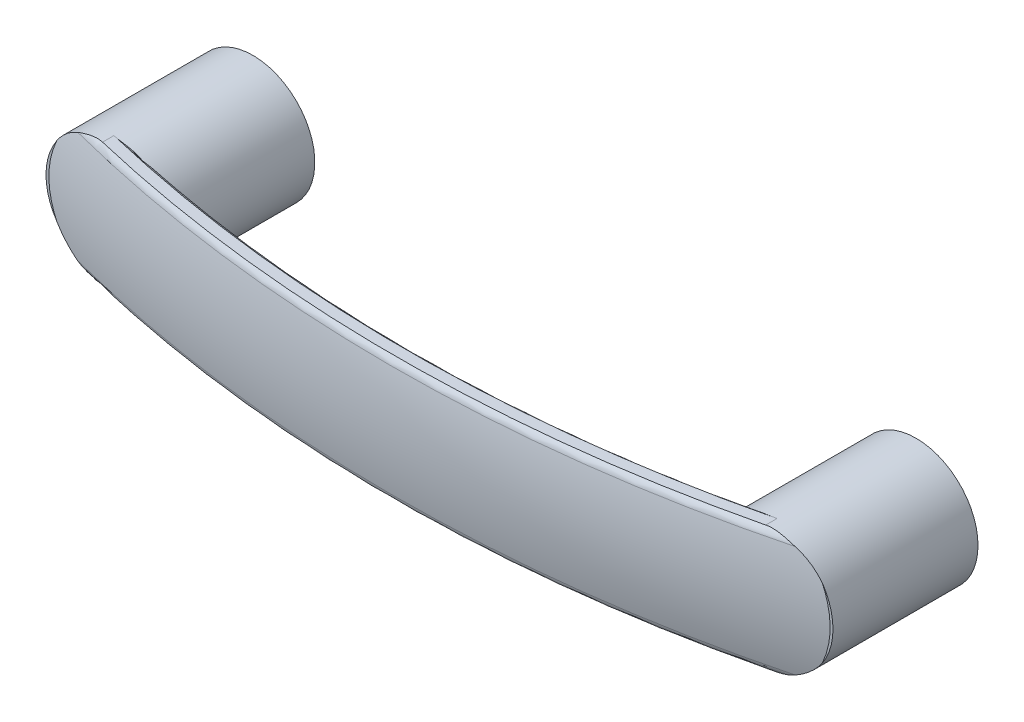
ISO-10303-21;
HEADER;
FILE_DESCRIPTION(('STEP AP214'),'2;1');
FILE_NAME('part.step','',(''),(''),'','','');
FILE_SCHEMA(('AUTOMOTIVE_DESIGN { 1 0 10303 214 1 1 1 1 }'));
ENDSEC;
DATA;
#1=APPLICATION_CONTEXT('core data for automotive mechanical design processes');
#2=APPLICATION_PROTOCOL_DEFINITION('international standard','automotive_design',2000,#1);
#3=PRODUCT_CONTEXT('',#1,'mechanical');
#4=PRODUCT('Part','Part','',(#3));
#5=PRODUCT_RELATED_PRODUCT_CATEGORY('part','',(#4));
#6=PRODUCT_DEFINITION_FORMATION('','',#4);
#7=PRODUCT_DEFINITION_CONTEXT('part definition',#1,'design');
#8=PRODUCT_DEFINITION('design','',#6,#7);
#9=PRODUCT_DEFINITION_SHAPE('','',#8);
#10=(LENGTH_UNIT() NAMED_UNIT(*) SI_UNIT(.MILLI.,.METRE.));
#11=(NAMED_UNIT(*) PLANE_ANGLE_UNIT() SI_UNIT($,.RADIAN.));
#12=(NAMED_UNIT(*) SI_UNIT($,.STERADIAN.) SOLID_ANGLE_UNIT());
#13=UNCERTAINTY_MEASURE_WITH_UNIT(LENGTH_MEASURE(1.E-05),#10,'distance_accuracy_value','');
#14=(GEOMETRIC_REPRESENTATION_CONTEXT(3) GLOBAL_UNCERTAINTY_ASSIGNED_CONTEXT((#13)) GLOBAL_UNIT_ASSIGNED_CONTEXT((#10,
#11,#12)) REPRESENTATION_CONTEXT('',''));
#15=CARTESIAN_POINT('',(0.,0.,0.));
#16=DIRECTION('',(0.,0.,1.));
#17=DIRECTION('',(1.,0.,0.));
#18=AXIS2_PLACEMENT_3D('',#15,#16,#17);
#19=CARTESIAN_POINT('',(150.,0.,18.));
#20=DIRECTION('',(0.,0.,-1.));
#21=DIRECTION('',(-1.,0.,0.));
#22=AXIS2_PLACEMENT_3D('',#19,#20,#21);
#23=PLANE('',#22);
#24=CARTESIAN_POINT('',(150.,0.,18.));
#25=DIRECTION('',(0.,0.,-1.));
#26=DIRECTION('',(-1.,0.,0.));
#27=AXIS2_PLACEMENT_3D('',#24,#25,#26);
#28=CIRCLE('',#27,4.25);
#29=CARTESIAN_POINT('',(145.75,0.,18.));
#30=VERTEX_POINT('',#29);
#31=EDGE_CURVE('E200',#30,#30,#28,.T.);
#32=ORIENTED_EDGE('',*,*,#31,.T.);
#33=EDGE_LOOP('',(#32));
#34=FACE_BOUND('',#33,.T.);
#35=DIRECTION('',(-0.866025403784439,0.5,0.));
#36=VECTOR('',#35,1.);
#37=CARTESIAN_POINT('',(156.5,3.75277674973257,18.));
#38=LINE('',#37,#36);
#39=CARTESIAN_POINT('',(156.5,3.75277674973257,18.));
#40=VERTEX_POINT('',#39);
#41=CARTESIAN_POINT('',(150.,7.50555349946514,18.));
#42=VERTEX_POINT('',#41);
#43=EDGE_CURVE('E225',#40,#42,#38,.T.);
#44=ORIENTED_EDGE('',*,*,#43,.T.);
#45=DIRECTION('',(-0.866025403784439,-0.5,0.));
#46=VECTOR('',#45,1.);
#47=CARTESIAN_POINT('',(150.,7.50555349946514,18.));
#48=LINE('',#47,#46);
#49=CARTESIAN_POINT('',(143.5,3.75277674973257,18.));
#50=VERTEX_POINT('',#49);
#51=EDGE_CURVE('E228',#42,#50,#48,.T.);
#52=ORIENTED_EDGE('',*,*,#51,.T.);
#53=DIRECTION('',(0.,-1.,0.));
#54=VECTOR('',#53,1.);
#55=CARTESIAN_POINT('',(143.5,3.75277674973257,18.));
#56=LINE('',#55,#54);
#57=CARTESIAN_POINT('',(143.5,-3.75277674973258,18.));
#58=VERTEX_POINT('',#57);
#59=EDGE_CURVE('E230',#50,#58,#56,.T.);
#60=ORIENTED_EDGE('',*,*,#59,.T.);
#61=DIRECTION('',(0.866025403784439,-0.5,0.));
#62=VECTOR('',#61,1.);
#63=CARTESIAN_POINT('',(143.5,-3.75277674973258,18.));
#64=LINE('',#63,#62);
#65=CARTESIAN_POINT('',(150.,-7.50555349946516,18.));
#66=VERTEX_POINT('',#65);
#67=EDGE_CURVE('E232',#58,#66,#64,.T.);
#68=ORIENTED_EDGE('',*,*,#67,.T.);
#69=DIRECTION('',(0.866025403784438,0.5,0.));
#70=VECTOR('',#69,1.);
#71=CARTESIAN_POINT('',(150.,-7.50555349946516,18.));
#72=LINE('',#71,#70);
#73=CARTESIAN_POINT('',(156.5,-3.75277674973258,18.));
#74=VERTEX_POINT('',#73);
#75=EDGE_CURVE('E234',#66,#74,#72,.T.);
#76=ORIENTED_EDGE('',*,*,#75,.T.);
#77=DIRECTION('',(0.,1.,0.));
#78=VECTOR('',#77,1.);
#79=CARTESIAN_POINT('',(156.5,-3.75277674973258,18.));
#80=LINE('',#79,#78);
#81=EDGE_CURVE('E214',#74,#40,#80,.T.);
#82=ORIENTED_EDGE('',*,*,#81,.T.);
#83=EDGE_LOOP('',(#44,#52,#60,#68,#76,#82));
#84=FACE_BOUND('',#83,.T.);
#85=ADVANCED_FACE('F14',(#34,#84),#23,.F.);
#86=CARTESIAN_POINT('',(0.,0.,18.));
#87=DIRECTION('',(0.,0.,-1.));
#88=DIRECTION('',(-1.,0.,0.));
#89=AXIS2_PLACEMENT_3D('',#86,#87,#88);
#90=PLANE('',#89);
#91=CARTESIAN_POINT('',(0.,0.,18.));
#92=DIRECTION('',(0.,0.,-1.));
#93=DIRECTION('',(-1.,0.,0.));
#94=AXIS2_PLACEMENT_3D('',#91,#92,#93);
#95=CIRCLE('',#94,4.25);
#96=CARTESIAN_POINT('',(-4.25,0.,18.));
#97=VERTEX_POINT('',#96);
#98=EDGE_CURVE('E204',#97,#97,#95,.T.);
#99=ORIENTED_EDGE('',*,*,#98,.T.);
#100=EDGE_LOOP('',(#99));
#101=FACE_BOUND('',#100,.T.);
#102=DIRECTION('',(-0.866025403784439,0.5,0.));
#103=VECTOR('',#102,1.);
#104=CARTESIAN_POINT('',(6.5,3.75277674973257,18.));
#105=LINE('',#104,#103);
#106=CARTESIAN_POINT('',(6.5,3.75277674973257,18.));
#107=VERTEX_POINT('',#106);
#108=CARTESIAN_POINT('',(0.,7.50555349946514,18.));
#109=VERTEX_POINT('',#108);
#110=EDGE_CURVE('E254',#107,#109,#105,.T.);
#111=ORIENTED_EDGE('',*,*,#110,.T.);
#112=DIRECTION('',(-0.866025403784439,-0.5,0.));
#113=VECTOR('',#112,1.);
#114=CARTESIAN_POINT('',(0.,7.50555349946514,18.));
#115=LINE('',#114,#113);
#116=CARTESIAN_POINT('',(-6.5,3.75277674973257,18.));
#117=VERTEX_POINT('',#116);
#118=EDGE_CURVE('E199',#109,#117,#115,.T.);
#119=ORIENTED_EDGE('',*,*,#118,.T.);
#120=DIRECTION('',(0.,-1.,0.));
#121=VECTOR('',#120,1.);
#122=CARTESIAN_POINT('',(-6.5,3.75277674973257,18.));
#123=LINE('',#122,#121);
#124=CARTESIAN_POINT('',(-6.5,-3.75277674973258,18.));
#125=VERTEX_POINT('',#124);
#126=EDGE_CURVE('E493',#117,#125,#123,.T.);
#127=ORIENTED_EDGE('',*,*,#126,.T.);
#128=DIRECTION('',(0.866025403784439,-0.5,0.));
#129=VECTOR('',#128,1.);
#130=CARTESIAN_POINT('',(-6.5,-3.75277674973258,18.));
#131=LINE('',#130,#129);
#132=CARTESIAN_POINT('',(0.,-7.50555349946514,18.));
#133=VERTEX_POINT('',#132);
#134=EDGE_CURVE('E500',#125,#133,#131,.T.);
#135=ORIENTED_EDGE('',*,*,#134,.T.);
#136=DIRECTION('',(0.866025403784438,0.5,0.));
#137=VECTOR('',#136,1.);
#138=CARTESIAN_POINT('',(0.,-7.50555349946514,18.));
#139=LINE('',#138,#137);
#140=CARTESIAN_POINT('',(6.5,-3.75277674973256,18.));
#141=VERTEX_POINT('',#140);
#142=EDGE_CURVE('E502',#133,#141,#139,.T.);
#143=ORIENTED_EDGE('',*,*,#142,.T.);
#144=DIRECTION('',(0.,1.,0.));
#145=VECTOR('',#144,1.);
#146=CARTESIAN_POINT('',(6.5,-3.75277674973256,18.));
#147=LINE('',#146,#145);
#148=EDGE_CURVE('E196',#141,#107,#147,.T.);
#149=ORIENTED_EDGE('',*,*,#148,.T.);
#150=EDGE_LOOP('',(#111,#119,#127,#135,#143,#149));
#151=FACE_BOUND('',#150,.T.);
#152=ADVANCED_FACE('F449',(#101,#151),#90,.F.);
#153=CARTESIAN_POINT('',(-0.255140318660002,0.,0.));
#154=DIRECTION('',(0.,0.,1.));
#155=DIRECTION('',(0.,-1.,0.));
#156=AXIS2_PLACEMENT_3D('',#153,#154,#155);
#157=PLANE('',#156);
#158=CARTESIAN_POINT('',(0.,0.,0.));
#159=DIRECTION('',(0.,0.,-1.));
#160=DIRECTION('',(-1.,0.,0.));
#161=AXIS2_PLACEMENT_3D('',#158,#159,#160);
#162=CIRCLE('',#161,4.25);
#163=CARTESIAN_POINT('',(-4.25,0.,0.));
#164=VERTEX_POINT('',#163);
#165=EDGE_CURVE('E258',#164,#164,#162,.T.);
#166=ORIENTED_EDGE('',*,*,#165,.F.);
#167=EDGE_LOOP('',(#166));
#168=FACE_BOUND('',#167,.T.);
#169=CARTESIAN_POINT('',(0.,0.,0.));
#170=DIRECTION('',(0.,0.,1.));
#171=DIRECTION('',(-1.,0.,0.));
#172=AXIS2_PLACEMENT_3D('',#169,#170,#171);
#173=CIRCLE('',#172,14.);
#174=CARTESIAN_POINT('',(-14.,0.,0.));
#175=VERTEX_POINT('',#174);
#176=EDGE_CURVE('E332',#175,#175,#173,.T.);
#177=ORIENTED_EDGE('',*,*,#176,.F.);
#178=EDGE_LOOP('',(#177));
#179=FACE_BOUND('',#178,.T.);
#180=ADVANCED_FACE('F447',(#168,#179),#157,.F.);
#181=CARTESIAN_POINT('',(-0.255140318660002,0.,32.8));
#182=DIRECTION('',(0.,0.,1.));
#183=DIRECTION('',(0.,-1.,0.));
#184=AXIS2_PLACEMENT_3D('',#181,#182,#183);
#185=PLANE('',#184);
#186=CARTESIAN_POINT('',(0.,0.,32.8));
#187=DIRECTION('',(0.,0.,1.));
#188=DIRECTION('',(1.,0.,0.));
#189=AXIS2_PLACEMENT_3D('',#186,#187,#188);
#190=CIRCLE('',#189,14.);
#191=CARTESIAN_POINT('',(-11.5953620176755,-7.84522655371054,32.8));
#192=VERTEX_POINT('',#191);
#193=CARTESIAN_POINT('',(-11.5953620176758,7.8452265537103,32.8));
#194=VERTEX_POINT('',#193);
#195=EDGE_CURVE('E9',#192,#194,#190,.F.);
#196=ORIENTED_EDGE('',*,*,#195,.F.);
#197=CARTESIAN_POINT('',(-13.3490803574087,1.41218032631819E-13,32.8));
#198=CARTESIAN_POINT('',(-13.3490709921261,-0.569935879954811,32.8));
#199=CARTESIAN_POINT('',(-13.3215830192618,-1.14012000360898,32.8));
#200=CARTESIAN_POINT('',(-13.2123860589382,-2.27554882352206,32.8));
#201=CARTESIAN_POINT('',(-13.1306350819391,-2.84078935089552,32.8));
#202=CARTESIAN_POINT('',(-12.9149496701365,-3.9626413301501,32.8));
#203=CARTESIAN_POINT('',(-12.7808871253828,-4.51922808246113,32.8));
#204=CARTESIAN_POINT('',(-12.464044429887,-5.61855917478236,32.8));
#205=CARTESIAN_POINT('',(-12.2812397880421,-6.16129640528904,32.8));
#206=CARTESIAN_POINT('',(-11.8733813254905,-7.2239957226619,32.8));
#207=CARTESIAN_POINT('',(-11.648794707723,-7.74413795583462,32.8));
#208=CARTESIAN_POINT('',(-11.1605291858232,-8.76583164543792,32.8));
#209=CARTESIAN_POINT('',(-10.896833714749,-9.2673751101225,32.8));
#210=CARTESIAN_POINT('',(-10.0541492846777,-10.7414126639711,32.8));
#211=CARTESIAN_POINT('',(-9.42309640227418,-11.684483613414,32.8));
#212=CARTESIAN_POINT('',(-8.14542950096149,-13.3693211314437,32.8));
#213=CARTESIAN_POINT('',(-7.51184390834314,-14.1212333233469,32.8));
#214=CARTESIAN_POINT('',(-6.18084712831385,-15.5669262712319,32.8));
#215=CARTESIAN_POINT('',(-5.48339382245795,-16.2606680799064,32.8));
#216=CARTESIAN_POINT('',(-4.03645149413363,-17.5950112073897,32.8));
#217=CARTESIAN_POINT('',(-3.28683177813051,-18.2354695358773,32.8));
#218=CARTESIAN_POINT('',(-1.74707423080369,-19.4660253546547,32.8));
#219=CARTESIAN_POINT('',(-0.956920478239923,-20.056102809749,32.8));
#220=CARTESIAN_POINT('',(0.604773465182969,-21.1541493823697,32.8));
#221=CARTESIAN_POINT('',(1.37433478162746,-21.6649507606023,32.8));
#222=CARTESIAN_POINT('',(2.93671257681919,-22.6492343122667,32.8));
#223=CARTESIAN_POINT('',(3.72952536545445,-23.1227223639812,32.8));
#224=CARTESIAN_POINT('',(5.33522483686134,-24.0359010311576,32.8));
#225=CARTESIAN_POINT('',(6.14812840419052,-24.475561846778,32.8));
#226=CARTESIAN_POINT('',(7.79019304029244,-25.3233754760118,32.8));
#227=CARTESIAN_POINT('',(8.61935474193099,-25.7315270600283,32.8));
#228=CARTESIAN_POINT('',(10.2927492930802,-26.5193919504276,32.8));
#229=CARTESIAN_POINT('',(11.1370051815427,-26.899056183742,32.8));
#230=CARTESIAN_POINT('',(12.837113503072,-27.6313371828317,32.8));
#231=CARTESIAN_POINT('',(13.6929656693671,-27.9839545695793,32.8));
#232=CARTESIAN_POINT('',(15.4142797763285,-28.6639496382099,32.8));
#233=CARTESIAN_POINT('',(16.2797383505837,-28.9913358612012,32.8));
#234=CARTESIAN_POINT('',(18.0191662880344,-29.6227044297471,32.8));
#235=CARTESIAN_POINT('',(18.89313597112,-29.9266858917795,32.8));
#236=CARTESIAN_POINT('',(20.729997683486,-30.5399909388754,32.8));
#237=CARTESIAN_POINT('',(21.6936011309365,-30.8471826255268,32.8));
#238=CARTESIAN_POINT('',(23.6282781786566,-31.4371256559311,32.8));
#239=CARTESIAN_POINT('',(24.5993521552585,-31.7198757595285,32.8));
#240=CARTESIAN_POINT('',(27.522440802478,-32.5338826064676,32.8));
#241=CARTESIAN_POINT('',(29.4840840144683,-33.0308173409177,32.8));
#242=CARTESIAN_POINT('',(33.4278863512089,-33.9436771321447,32.8));
#243=CARTESIAN_POINT('',(35.4100635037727,-34.3595232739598,32.8));
#244=CARTESIAN_POINT('',(39.3882486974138,-35.1174744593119,32.8));
#245=CARTESIAN_POINT('',(41.3842557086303,-35.4595849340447,32.8));
#246=CARTESIAN_POINT('',(45.3917301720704,-36.0770097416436,32.8));
#247=CARTESIAN_POINT('',(47.4032241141,-36.3521509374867,32.8));
#248=CARTESIAN_POINT('',(51.4338330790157,-36.8392239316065,32.8));
#249=CARTESIAN_POINT('',(53.4529482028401,-37.0511548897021,32.8));
#250=CARTESIAN_POINT('',(57.4954781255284,-37.4152116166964,32.8));
#251=CARTESIAN_POINT('',(59.5188901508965,-37.5673683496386,32.8));
#252=CARTESIAN_POINT('',(63.5691860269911,-37.8144735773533,32.8));
#253=CARTESIAN_POINT('',(65.5960698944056,-37.9094217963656,32.8));
#254=CARTESIAN_POINT('',(69.9667812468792,-38.0540495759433,32.8));
#255=CARTESIAN_POINT('',(72.3109211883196,-38.0944031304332,32.8));
#256=CARTESIAN_POINT('',(76.9993547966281,-38.1016218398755,32.8));
#257=CARTESIAN_POINT('',(79.3436484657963,-38.0684852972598,32.8));
#258=CARTESIAN_POINT('',(84.0314425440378,-37.9279830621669,32.8));
#259=CARTESIAN_POINT('',(86.3749416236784,-37.8205726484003,32.8));
#260=CARTESIAN_POINT('',(91.0571697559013,-37.5292164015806,32.8));
#261=CARTESIAN_POINT('',(93.3958989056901,-37.3452721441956,32.8));
#262=CARTESIAN_POINT('',(98.063191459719,-36.8971222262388,32.8));
#263=CARTESIAN_POINT('',(100.39176300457,-36.633001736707,32.8));
#264=CARTESIAN_POINT('',(105.037852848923,-36.0185447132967,32.8));
#265=CARTESIAN_POINT('',(107.355370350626,-35.6682020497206,32.8));
#266=CARTESIAN_POINT('',(110.818275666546,-35.0720785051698,32.8));
#267=CARTESIAN_POINT('',(111.969830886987,-34.8617135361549,32.8));
#268=CARTESIAN_POINT('',(114.268106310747,-34.4161123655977,32.8));
#269=CARTESIAN_POINT('',(115.414826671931,-34.1808769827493,32.8));
#270=CARTESIAN_POINT('',(117.702376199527,-33.6841023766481,32.8));
#271=CARTESIAN_POINT('',(118.843206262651,-33.4225672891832,32.8));
#272=CARTESIAN_POINT('',(121.118039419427,-32.8714640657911,32.8));
#273=CARTESIAN_POINT('',(122.252042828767,-32.5818972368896,32.8));
#274=CARTESIAN_POINT('',(124.455555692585,-31.9879558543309,32.8));
#275=CARTESIAN_POINT('',(125.525458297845,-31.6850425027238,32.8));
#276=CARTESIAN_POINT('',(127.656605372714,-31.0501791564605,32.8));
#277=CARTESIAN_POINT('',(128.71785008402,-30.7182299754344,32.8));
#278=CARTESIAN_POINT('',(130.83057501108,-30.0228805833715,32.8));
#279=CARTESIAN_POINT('',(131.882050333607,-29.6594654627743,32.8));
#280=CARTESIAN_POINT('',(133.97269434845,-28.8987348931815,32.8));
#281=CARTESIAN_POINT('',(135.011863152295,-28.5014197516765,32.8));
#282=CARTESIAN_POINT('',(137.069942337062,-27.6720906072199,32.8));
#283=CARTESIAN_POINT('',(138.088930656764,-27.2402706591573,32.8));
#284=CARTESIAN_POINT('',(140.109212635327,-26.3366853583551,32.8));
#285=CARTESIAN_POINT('',(141.110504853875,-25.8649167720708,32.8));
#286=CARTESIAN_POINT('',(143.090291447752,-24.878045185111,32.8));
#287=CARTESIAN_POINT('',(144.068808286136,-24.3629874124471,32.8));
#288=CARTESIAN_POINT('',(145.998777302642,-23.2847161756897,32.8));
#289=CARTESIAN_POINT('',(146.950236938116,-22.7215161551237,32.8));
#290=CARTESIAN_POINT('',(148.55229757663,-21.710373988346,32.8));
#291=CARTESIAN_POINT('',(149.211155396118,-21.275504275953,32.8));
#292=CARTESIAN_POINT('',(150.508585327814,-20.376436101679,32.8));
#293=CARTESIAN_POINT('',(151.147158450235,-19.9122391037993,32.8));
#294=CARTESIAN_POINT('',(152.40114019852,-18.951580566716,32.8));
#295=CARTESIAN_POINT('',(153.016513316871,-18.4550725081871,32.8));
#296=CARTESIAN_POINT('',(154.21836783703,-17.4280855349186,32.8));
#297=CARTESIAN_POINT('',(154.804848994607,-16.8976063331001,32.8));
#298=CARTESIAN_POINT('',(155.94890990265,-15.7947763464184,32.8));
#299=CARTESIAN_POINT('',(156.506130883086,-15.222051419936,32.8));
#300=CARTESIAN_POINT('',(157.57775105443,-14.0374719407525,32.8));
#301=CARTESIAN_POINT('',(158.092144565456,-13.425612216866,32.8));
#302=CARTESIAN_POINT('',(159.067967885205,-12.1627900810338,32.8));
#303=CARTESIAN_POINT('',(159.529504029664,-11.5119103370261,32.8));
#304=CARTESIAN_POINT('',(160.390010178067,-10.1700444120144,32.8));
#305=CARTESIAN_POINT('',(160.789013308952,-9.47907973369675,32.8));
#306=CARTESIAN_POINT('',(161.396300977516,-8.28741752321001,32.8));
#307=CARTESIAN_POINT('',(161.624674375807,-7.79691203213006,32.8));
#308=CARTESIAN_POINT('',(162.043253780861,-6.79992921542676,32.8));
#309=CARTESIAN_POINT('',(162.233470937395,-6.29345660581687,32.8));
#310=CARTESIAN_POINT('',(162.57191600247,-5.267023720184,32.8));
#311=CARTESIAN_POINT('',(162.720174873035,-4.74707370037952,32.8));
#312=CARTESIAN_POINT('',(162.971585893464,-3.69631165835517,32.8));
#313=CARTESIAN_POINT('',(163.074737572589,-3.16549952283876,32.8));
#314=CARTESIAN_POINT('',(163.233854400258,-2.09362456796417,32.8));
#315=CARTESIAN_POINT('',(163.289539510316,-1.55251990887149,32.8));
#316=CARTESIAN_POINT('',(163.351218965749,-0.467470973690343,32.8));
#317=CARTESIAN_POINT('',(163.35721356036,0.0764732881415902,32.8));
#318=CARTESIAN_POINT('',(163.319348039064,1.16269814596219,32.8));
#319=CARTESIAN_POINT('',(163.275479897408,1.70497846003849,32.8));
#320=CARTESIAN_POINT('',(163.139047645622,2.78334261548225,32.8));
#321=CARTESIAN_POINT('',(163.046484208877,3.31942654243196,32.8));
#322=CARTESIAN_POINT('',(162.823369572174,4.34313329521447,32.8));
#323=CARTESIAN_POINT('',(162.696036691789,4.83146438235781,32.8));
#324=CARTESIAN_POINT('',(162.403985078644,5.79694207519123,32.8));
#325=CARTESIAN_POINT('',(162.239254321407,6.27408502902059,32.8));
#326=CARTESIAN_POINT('',(161.875391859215,7.21499047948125,32.8));
#327=CARTESIAN_POINT('',(161.676261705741,7.67875357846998,32.8));
#328=CARTESIAN_POINT('',(161.246701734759,8.59159576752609,32.8));
#329=CARTESIAN_POINT('',(161.016264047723,9.04067113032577,32.8));
#330=CARTESIAN_POINT('',(160.388824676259,10.1729247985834,32.8));
#331=CARTESIAN_POINT('',(159.971344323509,10.8448156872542,32.8));
#332=CARTESIAN_POINT('',(159.078525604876,12.1490720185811,32.8));
#333=CARTESIAN_POINT('',(158.603154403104,12.781414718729,32.8));
#334=CARTESIAN_POINT('',(157.603341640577,14.0083401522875,32.8));
#335=CARTESIAN_POINT('',(157.07878510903,14.6028286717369,32.8));
#336=CARTESIAN_POINT('',(155.989992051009,15.7538584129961,32.8));
#337=CARTESIAN_POINT('',(155.425762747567,16.3104065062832,32.8));
#338=CARTESIAN_POINT('',(154.346576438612,17.3115185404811,32.8));
#339=CARTESIAN_POINT('',(153.835951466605,17.7607820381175,32.8));
#340=CARTESIAN_POINT('',(152.793861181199,18.6345171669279,32.8));
#341=CARTESIAN_POINT('',(152.262392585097,19.0589848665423,32.8));
#342=CARTESIAN_POINT('',(150.640746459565,20.2978002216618,32.8));
#343=CARTESIAN_POINT('',(149.523733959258,21.0771911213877,32.8));
#344=CARTESIAN_POINT('',(147.23529441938,22.554585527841,32.8));
#345=CARTESIAN_POINT('',(146.063781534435,23.2524541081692,32.8));
#346=CARTESIAN_POINT('',(143.680776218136,24.5751352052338,32.8));
#347=CARTESIAN_POINT('',(142.469292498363,25.1999635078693,32.8));
#348=CARTESIAN_POINT('',(139.971181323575,26.4062983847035,32.8));
#349=CARTESIAN_POINT('',(138.683418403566,26.9854383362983,32.8));
#350=CARTESIAN_POINT('',(136.081761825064,28.0821553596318,32.8));
#351=CARTESIAN_POINT('',(134.767862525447,28.5997189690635,32.8));
#352=CARTESIAN_POINT('',(132.11853748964,29.5799471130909,32.8));
#353=CARTESIAN_POINT('',(130.783093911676,30.0425631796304,32.8));
#354=CARTESIAN_POINT('',(128.096054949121,30.9176678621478,32.8));
#355=CARTESIAN_POINT('',(126.74446063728,31.3301597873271,32.8));
#356=CARTESIAN_POINT('',(124.024012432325,32.1107093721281,32.8));
#357=CARTESIAN_POINT('',(122.655117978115,32.4786250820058,32.8));
#358=CARTESIAN_POINT('',(119.906721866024,33.1722897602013,32.8));
#359=CARTESIAN_POINT('',(118.527220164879,33.4980385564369,32.8));
#360=CARTESIAN_POINT('',(115.760207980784,34.1103915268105,32.8));
#361=CARTESIAN_POINT('',(114.372701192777,34.3970124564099,32.8));
#362=CARTESIAN_POINT('',(111.590654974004,34.9339283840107,32.8));
#363=CARTESIAN_POINT('',(110.19611531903,35.1842222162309,32.8));
#364=CARTESIAN_POINT('',(107.36024669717,35.6575528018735,32.8));
#365=CARTESIAN_POINT('',(105.918748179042,35.879571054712,32.8));
#366=CARTESIAN_POINT('',(103.030863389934,36.2894698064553,32.8));
#367=CARTESIAN_POINT('',(101.584476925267,36.4773489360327,32.8));
#368=CARTESIAN_POINT('',(98.6876621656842,36.8206304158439,32.8));
#369=CARTESIAN_POINT('',(97.2372333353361,36.9760282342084,32.8));
#370=CARTESIAN_POINT('',(94.3333383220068,37.2556469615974,32.8));
#371=CARTESIAN_POINT('',(92.8798720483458,37.3798669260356,32.8));
#372=CARTESIAN_POINT('',(89.9690191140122,37.5982888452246,32.8));
#373=CARTESIAN_POINT('',(88.5116298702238,37.692456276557,32.8));
#374=CARTESIAN_POINT('',(85.5952152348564,37.8513586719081,32.8));
#375=CARTESIAN_POINT('',(84.1361898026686,37.9160928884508,32.8));
#376=CARTESIAN_POINT('',(81.2172949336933,38.0166484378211,32.8));
#377=CARTESIAN_POINT('',(79.7574255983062,38.0524727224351,32.8));
#378=CARTESIAN_POINT('',(76.8372265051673,38.0955101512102,32.8));
#379=CARTESIAN_POINT('',(75.3768967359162,38.1027225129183,32.8));
#380=CARTESIAN_POINT('',(72.4566049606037,38.0885932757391,32.8));
#381=CARTESIAN_POINT('',(70.9966429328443,38.0672561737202,32.8));
#382=CARTESIAN_POINT('',(68.0774597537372,37.9958644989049,32.8));
#383=CARTESIAN_POINT('',(66.6182385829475,37.9458107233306,32.8));
#384=CARTESIAN_POINT('',(63.7009263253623,37.8165728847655,32.8));
#385=CARTESIAN_POINT('',(62.2428353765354,37.7373856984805,32.8));
#386=CARTESIAN_POINT('',(59.3286089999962,37.5492348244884,32.8));
#387=CARTESIAN_POINT('',(57.8724735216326,37.440271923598,32.8));
#388=CARTESIAN_POINT('',(54.9645370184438,37.1918095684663,32.8));
#389=CARTESIAN_POINT('',(53.5127329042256,37.0523463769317,32.8));
#390=CARTESIAN_POINT('',(50.6125665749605,36.741635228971,32.8));
#391=CARTESIAN_POINT('',(49.1642042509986,36.5703882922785,32.8));
#392=CARTESIAN_POINT('',(46.271999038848,36.1946525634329,32.8));
#393=CARTESIAN_POINT('',(44.8281555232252,35.9901686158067,32.8));
#394=CARTESIAN_POINT('',(41.9459159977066,35.546131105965,32.8));
#395=CARTESIAN_POINT('',(40.5075197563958,35.3065790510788,32.8));
#396=CARTESIAN_POINT('',(37.6693206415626,34.7959335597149,32.8));
#397=CARTESIAN_POINT('',(36.2693707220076,34.5256597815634,32.8));
#398=CARTESIAN_POINT('',(33.4774009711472,33.9470063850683,32.8));
#399=CARTESIAN_POINT('',(32.0853808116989,33.6386283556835,32.8));
#400=CARTESIAN_POINT('',(29.3103126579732,32.9806334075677,32.8));
#401=CARTESIAN_POINT('',(27.9272697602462,32.6309949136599,32.8));
#402=CARTESIAN_POINT('',(25.1731527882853,31.8870729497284,32.8));
#403=CARTESIAN_POINT('',(23.8020790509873,31.4927882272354,32.8));
#404=CARTESIAN_POINT('',(21.0770552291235,30.6560443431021,32.8));
#405=CARTESIAN_POINT('',(19.7230811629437,30.2136636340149,32.8));
#406=CARTESIAN_POINT('',(17.0338471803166,29.2752181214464,32.8));
#407=CARTESIAN_POINT('',(15.698586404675,28.7791557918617,32.8));
#408=CARTESIAN_POINT('',(13.0532964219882,27.7279498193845,32.8));
#409=CARTESIAN_POINT('',(11.743237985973,27.1728801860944,32.8));
#410=CARTESIAN_POINT('',(9.15306547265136,25.9958224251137,32.8));
#411=CARTESIAN_POINT('',(7.8729576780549,25.3738204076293,32.8));
#412=CARTESIAN_POINT('',(5.33952548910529,24.0477371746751,32.8));
#413=CARTESIAN_POINT('',(4.08658428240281,23.3429143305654,32.8));
#414=CARTESIAN_POINT('',(2.2476867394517,22.2201340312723,32.8));
#415=CARTESIAN_POINT('',(1.64157360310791,21.8350211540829,32.8));
#416=CARTESIAN_POINT('',(0.444933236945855,21.0413518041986,32.8));
#417=CARTESIAN_POINT('',(-0.145595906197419,20.6327982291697,32.8));
#418=CARTESIAN_POINT('',(-1.30561608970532,19.7927215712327,32.8));
#419=CARTESIAN_POINT('',(-1.87519782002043,19.3613240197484,32.8));
#420=CARTESIAN_POINT('',(-2.99323824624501,18.4720936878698,32.8));
#421=CARTESIAN_POINT('',(-3.54170088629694,18.0142658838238,32.8));
#422=CARTESIAN_POINT('',(-4.61329676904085,17.0709132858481,32.8));
#423=CARTESIAN_POINT('',(-5.1364568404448,16.5854190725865,32.8));
#424=CARTESIAN_POINT('',(-6.15345635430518,15.584767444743,32.8));
#425=CARTESIAN_POINT('',(-6.64730408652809,15.0696184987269,32.8));
#426=CARTESIAN_POINT('',(-7.54172178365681,14.0734871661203,32.8));
#427=CARTESIAN_POINT('',(-7.94629131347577,13.5961031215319,32.8));
#428=CARTESIAN_POINT('',(-8.72449174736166,12.6167150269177,32.8));
#429=CARTESIAN_POINT('',(-9.09812569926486,12.1147134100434,32.8));
#430=CARTESIAN_POINT('',(-9.8098475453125,11.0854158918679,32.8));
#431=CARTESIAN_POINT('',(-10.1479073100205,10.5581004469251,32.8));
#432=CARTESIAN_POINT('',(-10.7827309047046,9.47880542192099,32.8));
#433=CARTESIAN_POINT('',(-11.0794809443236,8.92681768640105,32.8));
#434=CARTESIAN_POINT('',(-11.6294364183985,7.79184869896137,32.8));
#435=CARTESIAN_POINT('',(-11.8819739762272,7.20854170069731,32.8));
#436=CARTESIAN_POINT('',(-12.3319156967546,6.02131813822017,32.8));
#437=CARTESIAN_POINT('',(-12.5293559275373,5.41741534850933,32.8));
#438=CARTESIAN_POINT('',(-12.8630031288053,4.1949872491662,32.8));
#439=CARTESIAN_POINT('',(-12.9994094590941,3.57651659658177,32.8));
#440=CARTESIAN_POINT('',(-13.2073334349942,2.3291085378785,32.8));
#441=CARTESIAN_POINT('',(-13.2789147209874,1.70018201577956,32.8));
#442=CARTESIAN_POINT('',(-13.3276159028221,0.891514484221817,32.8));
#443=CARTESIAN_POINT('',(-13.3356601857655,0.713322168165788,32.8));
#444=CARTESIAN_POINT('',(-13.3463940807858,0.356761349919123,32.8));
#445=CARTESIAN_POINT('',(-13.3490832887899,0.178392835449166,32.8));
#446=CARTESIAN_POINT('',(-13.3490803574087,1.41218032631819E-13,32.8));
#447=B_SPLINE_CURVE_WITH_KNOTS('',3,(#197,#198,#199,#200,#201,#202,#203,#204,#205,#206,#207,
#208,#209,#210,#211,#212,#213,#214,#215,#216,#217,#218,#219,#220,#221,#222,#223,#224,#225,#226,
#227,#228,#229,#230,#231,#232,#233,#234,#235,#236,#237,#238,#239,#240,#241,#242,#243,#244,#245,
#246,#247,#248,#249,#250,#251,#252,#253,#254,#255,#256,#257,#258,#259,#260,#261,#262,#263,#264,
#265,#266,#267,#268,#269,#270,#271,#272,#273,#274,#275,#276,#277,#278,#279,#280,#281,#282,#283,
#284,#285,#286,#287,#288,#289,#290,#291,#292,#293,#294,#295,#296,#297,#298,#299,#300,#301,#302,
#303,#304,#305,#306,#307,#308,#309,#310,#311,#312,#313,#314,#315,#316,#317,#318,#319,#320,#321,
#322,#323,#324,#325,#326,#327,#328,#329,#330,#331,#332,#333,#334,#335,#336,#337,#338,#339,#340,
#341,#342,#343,#344,#345,#346,#347,#348,#349,#350,#351,#352,#353,#354,#355,#356,#357,#358,#359,
#360,#361,#362,#363,#364,#365,#366,#367,#368,#369,#370,#371,#372,#373,#374,#375,#376,#377,#378,
#379,#380,#381,#382,#383,#384,#385,#386,#387,#388,#389,#390,#391,#392,#393,#394,#395,#396,#397,
#398,#399,#400,#401,#402,#403,#404,#405,#406,#407,#408,#409,#410,#411,#412,#413,#414,#415,#416,
#417,#418,#419,#420,#421,#422,#423,#424,#425,#426,#427,#428,#429,#430,#431,#432,#433,#434,#435,
#436,#437,#438,#439,#440,#441,#442,#443,#444,#445,#446),.UNSPECIFIED.,.T.,.F.,(4,2,2,2,2,2,2,2,
2,2,2,2,2,2,2,2,2,2,2,2,2,2,2,2,2,2,2,2,2,2,2,2,2,2,2,2,2,2,2,2,2,2,2,2,2,2,2,2,2,2,2,2,2,2,2,2,
2,2,2,2,2,2,2,2,2,2,2,2,2,2,2,2,2,2,2,2,2,2,2,2,2,2,2,2,2,2,2,2,2,2,2,2,2,2,2,2,2,2,2,2,2,2,2,2,
2,2,2,2,2,2,2,2,2,2,2,2,2,2,2,2,2,2,2,2,4),(0.,1.70958586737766,3.42049618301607,
5.1356230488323,6.8516133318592,8.54945795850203,10.2480238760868,13.6414142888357,
16.5872705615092,19.535083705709,22.4905681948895,25.4472225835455,28.2170459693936,
30.9864321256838,33.7582306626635,36.5301373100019,39.3067142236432,42.0832273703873,
44.8587964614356,47.6344702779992,50.6682589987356,53.7022015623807,59.7708382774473,
65.8453517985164,71.9194177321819,78.0090241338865,84.0987114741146,90.1852400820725,
96.2717980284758,103.304071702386,110.336507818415,117.373181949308,124.409711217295,
131.438791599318,138.468371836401,141.979985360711,145.491483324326,149.002429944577,
152.513212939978,155.848705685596,159.184104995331,162.52109346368,165.858051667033,
169.177410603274,172.497038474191,175.813240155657,179.12851880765,181.496129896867,
183.863622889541,186.234603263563,188.605603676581,191.000959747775,193.396632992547,
195.787398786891,198.176893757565,199.798700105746,201.420031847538,203.040164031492,
204.660313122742,206.289955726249,207.919590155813,209.549486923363,211.179361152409,
212.691777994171,214.204681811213,215.717517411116,217.230733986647,219.6000209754,
221.970658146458,224.346981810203,226.722873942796,228.762428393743,230.802305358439,
234.883697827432,238.971752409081,243.058921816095,247.29310261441,251.528207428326,
255.767020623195,260.005553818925,264.25724806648,268.508959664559,272.758844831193,
277.008866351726,281.383919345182,285.759147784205,290.134986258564,294.510957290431,
298.891937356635,303.273028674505,307.653672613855,312.034436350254,316.414510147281,
320.794462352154,325.174884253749,329.555190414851,333.930316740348,338.305302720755,
342.679651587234,347.053812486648,351.330724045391,355.607457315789,359.88643689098,
364.165536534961,368.437758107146,372.709782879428,376.976511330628,381.244126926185,
385.553381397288,387.70727102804,389.860894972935,392.003713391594,394.146129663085,
396.286222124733,398.425706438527,400.301869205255,402.177846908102,404.055297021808,
405.933372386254,407.837744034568,409.740866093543,411.637725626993,413.532720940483,
414.067789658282,414.602898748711),.UNSPECIFIED.);
#448=EDGE_CURVE('E432',#194,#192,#447,.T.);
#449=ORIENTED_EDGE('',*,*,#448,.F.);
#450=EDGE_LOOP('',(#196,#449));
#451=FACE_BOUND('',#450,.T.);
#452=ADVANCED_FACE('F308',(#451),#185,.T.);
#453=CARTESIAN_POINT('',(150.25514031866,0.,32.8));
#454=DIRECTION('',(0.,0.,1.));
#455=DIRECTION('',(0.,-1.,0.));
#456=AXIS2_PLACEMENT_3D('',#453,#454,#455);
#457=PLANE('',#456);
#458=CARTESIAN_POINT('',(150.,0.,32.8));
#459=DIRECTION('',(0.,0.,1.));
#460=DIRECTION('',(1.,0.,0.));
#461=AXIS2_PLACEMENT_3D('',#458,#459,#460);
#462=CIRCLE('',#461,14.);
#463=CARTESIAN_POINT('',(161.595362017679,7.84522655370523,32.8));
#464=VERTEX_POINT('',#463);
#465=CARTESIAN_POINT('',(161.595362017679,-7.84522655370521,32.8));
#466=VERTEX_POINT('',#465);
#467=EDGE_CURVE('E339',#464,#466,#462,.F.);
#468=ORIENTED_EDGE('',*,*,#467,.F.);
#469=CARTESIAN_POINT('',(163.34908035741,1.41218032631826E-13,32.8));
#470=CARTESIAN_POINT('',(163.349070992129,0.56993587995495,32.8));
#471=CARTESIAN_POINT('',(163.321583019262,1.14012000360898,32.8));
#472=CARTESIAN_POINT('',(163.212386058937,2.275548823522,32.8));
#473=CARTESIAN_POINT('',(163.130635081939,2.84078935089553,32.8));
#474=CARTESIAN_POINT('',(162.914949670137,3.96264133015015,32.8));
#475=CARTESIAN_POINT('',(162.780887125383,4.51922808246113,32.8));
#476=CARTESIAN_POINT('',(162.464044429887,5.61855917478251,32.8));
#477=CARTESIAN_POINT('',(162.281239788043,6.16129640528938,32.8));
#478=CARTESIAN_POINT('',(161.873381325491,7.22399572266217,32.8));
#479=CARTESIAN_POINT('',(161.648794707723,7.74413795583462,32.8));
#480=CARTESIAN_POINT('',(161.160529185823,8.76583164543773,32.8));
#481=CARTESIAN_POINT('',(160.896833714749,9.26737511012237,32.8));
#482=CARTESIAN_POINT('',(160.054149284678,10.7414126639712,32.8));
#483=CARTESIAN_POINT('',(159.423096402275,11.6844836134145,32.8));
#484=CARTESIAN_POINT('',(158.145429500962,13.369321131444,32.8));
#485=CARTESIAN_POINT('',(157.511843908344,14.1212333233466,32.8));
#486=CARTESIAN_POINT('',(156.180847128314,15.5669262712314,32.8));
#487=CARTESIAN_POINT('',(155.483393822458,16.2606680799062,32.8));
#488=CARTESIAN_POINT('',(154.036451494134,17.5950112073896,32.8));
#489=CARTESIAN_POINT('',(153.286831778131,18.235469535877,32.8));
#490=CARTESIAN_POINT('',(151.747074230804,19.4660253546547,32.8));
#491=CARTESIAN_POINT('',(150.95692047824,20.0561028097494,32.8));
#492=CARTESIAN_POINT('',(149.395226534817,21.1541493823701,32.8));
#493=CARTESIAN_POINT('',(148.625665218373,21.6649507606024,32.8));
#494=CARTESIAN_POINT('',(147.063287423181,22.6492343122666,32.8));
#495=CARTESIAN_POINT('',(146.270474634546,23.1227223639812,32.8));
#496=CARTESIAN_POINT('',(144.664775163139,24.0359010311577,32.8));
#497=CARTESIAN_POINT('',(143.851871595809,24.475561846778,32.8));
#498=CARTESIAN_POINT('',(142.209806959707,25.3233754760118,32.8));
#499=CARTESIAN_POINT('',(141.380645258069,25.7315270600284,32.8));
#500=CARTESIAN_POINT('',(139.70725070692,26.5193919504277,32.8));
#501=CARTESIAN_POINT('',(138.862994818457,26.8990561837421,32.8));
#502=CARTESIAN_POINT('',(137.162886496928,27.6313371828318,32.8));
#503=CARTESIAN_POINT('',(136.307034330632,27.9839545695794,32.8));
#504=CARTESIAN_POINT('',(134.585720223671,28.66394963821,32.8));
#505=CARTESIAN_POINT('',(133.720261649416,28.9913358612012,32.8));
#506=CARTESIAN_POINT('',(131.980833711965,29.6227044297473,32.8));
#507=CARTESIAN_POINT('',(131.10686402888,29.9266858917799,32.8));
#508=CARTESIAN_POINT('',(129.270002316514,30.5399909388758,32.8));
#509=CARTESIAN_POINT('',(128.306398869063,30.847182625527,32.8));
#510=CARTESIAN_POINT('',(126.371721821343,31.4371256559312,32.8));
#511=CARTESIAN_POINT('',(125.400647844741,31.7198757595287,32.8));
#512=CARTESIAN_POINT('',(122.477559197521,32.5338826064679,32.8));
#513=CARTESIAN_POINT('',(120.515915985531,33.0308173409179,32.8));
#514=CARTESIAN_POINT('',(116.57211364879,33.9436771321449,32.8));
#515=CARTESIAN_POINT('',(114.589936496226,34.35952327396,32.8));
#516=CARTESIAN_POINT('',(110.611751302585,35.1174744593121,32.8));
#517=CARTESIAN_POINT('',(108.615744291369,35.4595849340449,32.8));
#518=CARTESIAN_POINT('',(104.608269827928,36.0770097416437,32.8));
#519=CARTESIAN_POINT('',(102.596775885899,36.3521509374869,32.8));
#520=CARTESIAN_POINT('',(98.5661669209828,36.8392239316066,32.8));
#521=CARTESIAN_POINT('',(96.5470517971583,37.0511548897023,32.8));
#522=CARTESIAN_POINT('',(92.5045218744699,37.4152116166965,32.8));
#523=CARTESIAN_POINT('',(90.4811098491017,37.5673683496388,32.8));
#524=CARTESIAN_POINT('',(86.430813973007,37.8144735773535,32.8));
#525=CARTESIAN_POINT('',(84.4039301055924,37.9094217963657,32.8));
#526=CARTESIAN_POINT('',(80.0332187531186,38.0540495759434,32.8));
#527=CARTESIAN_POINT('',(77.6890788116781,38.0944031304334,32.8));
#528=CARTESIAN_POINT('',(73.0006452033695,38.1016218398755,32.8));
#529=CARTESIAN_POINT('',(70.6563515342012,38.0684852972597,32.8));
#530=CARTESIAN_POINT('',(65.9685574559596,37.9279830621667,32.8));
#531=CARTESIAN_POINT('',(63.6250583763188,37.8205726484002,32.8));
#532=CARTESIAN_POINT('',(58.9428302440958,37.5292164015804,32.8));
#533=CARTESIAN_POINT('',(56.6041010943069,37.3452721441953,32.8));
#534=CARTESIAN_POINT('',(51.936808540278,36.8971222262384,32.8));
#535=CARTESIAN_POINT('',(49.6082369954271,36.6330017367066,32.8));
#536=CARTESIAN_POINT('',(44.9621471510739,36.0185447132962,32.8));
#537=CARTESIAN_POINT('',(42.6446296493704,35.66820204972,32.8));
#538=CARTESIAN_POINT('',(39.1817243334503,35.0720785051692,32.8));
#539=CARTESIAN_POINT('',(38.0301691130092,34.8617135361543,32.8));
#540=CARTESIAN_POINT('',(35.731893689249,34.416112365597,32.8));
#541=CARTESIAN_POINT('',(34.5851733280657,34.1808769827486,32.8));
#542=CARTESIAN_POINT('',(32.2976238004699,33.6841023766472,32.8));
#543=CARTESIAN_POINT('',(31.1567937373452,33.4225672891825,32.8));
#544=CARTESIAN_POINT('',(28.8819605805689,32.8714640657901,32.8));
#545=CARTESIAN_POINT('',(27.7479571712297,32.5818972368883,32.8));
#546=CARTESIAN_POINT('',(25.544444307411,31.9879558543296,32.8));
#547=CARTESIAN_POINT('',(24.4745417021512,31.6850425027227,32.8));
#548=CARTESIAN_POINT('',(22.3433946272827,31.0501791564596,32.8));
#549=CARTESIAN_POINT('',(21.2821499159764,30.7182299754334,32.8));
#550=CARTESIAN_POINT('',(19.1694249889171,30.0228805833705,32.8));
#551=CARTESIAN_POINT('',(18.11794966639,29.6594654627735,32.8));
#552=CARTESIAN_POINT('',(16.0273056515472,28.8987348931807,32.8));
#553=CARTESIAN_POINT('',(14.9881368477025,28.5014197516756,32.8));
#554=CARTESIAN_POINT('',(12.9300576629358,27.6720906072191,32.8));
#555=CARTESIAN_POINT('',(11.9110693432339,27.2402706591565,32.8));
#556=CARTESIAN_POINT('',(9.89078736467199,26.3366853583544,32.8));
#557=CARTESIAN_POINT('',(8.88949514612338,25.8649167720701,32.8));
#558=CARTESIAN_POINT('',(6.90970855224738,24.8780451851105,32.8));
#559=CARTESIAN_POINT('',(5.93119171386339,24.3629874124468,32.8));
#560=CARTESIAN_POINT('',(4.00122269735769,23.2847161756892,32.8));
#561=CARTESIAN_POINT('',(3.04976306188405,22.7215161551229,32.8));
#562=CARTESIAN_POINT('',(1.44770242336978,21.7103739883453,32.8));
#563=CARTESIAN_POINT('',(0.788844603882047,21.2755042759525,32.8));
#564=CARTESIAN_POINT('',(-0.508585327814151,20.3764361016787,32.8));
#565=CARTESIAN_POINT('',(-1.14715845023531,19.9122391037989,32.8));
#566=CARTESIAN_POINT('',(-2.40114019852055,18.9515805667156,32.8));
#567=CARTESIAN_POINT('',(-3.01651331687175,18.4550725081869,32.8));
#568=CARTESIAN_POINT('',(-4.21836783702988,17.428085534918,32.8));
#569=CARTESIAN_POINT('',(-4.80484899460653,16.8976063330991,32.8));
#570=CARTESIAN_POINT('',(-5.94890990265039,15.7947763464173,32.8));
#571=CARTESIAN_POINT('',(-6.50613088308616,15.2220514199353,32.8));
#572=CARTESIAN_POINT('',(-7.57775105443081,14.037471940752,32.8));
#573=CARTESIAN_POINT('',(-8.09214456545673,13.4256122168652,32.8));
#574=CARTESIAN_POINT('',(-9.06796788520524,12.162790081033,32.8));
#575=CARTESIAN_POINT('',(-9.52950402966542,11.5119103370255,32.8));
#576=CARTESIAN_POINT('',(-10.3900101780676,10.1700444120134,32.8));
#577=CARTESIAN_POINT('',(-10.7890133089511,9.47907973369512,32.8));
#578=CARTESIAN_POINT('',(-11.3963009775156,8.2874175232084,32.8));
#579=CARTESIAN_POINT('',(-11.6246743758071,7.79691203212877,32.8));
#580=CARTESIAN_POINT('',(-12.0432537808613,6.79992921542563,32.8));
#581=CARTESIAN_POINT('',(-12.2334709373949,6.29345660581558,32.8));
#582=CARTESIAN_POINT('',(-12.5719160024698,5.26702372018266,32.8));
#583=CARTESIAN_POINT('',(-12.7201748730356,4.74707370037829,32.8));
#584=CARTESIAN_POINT('',(-12.9715858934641,3.6963116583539,32.8));
#585=CARTESIAN_POINT('',(-13.0747375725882,3.16549952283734,32.8));
#586=CARTESIAN_POINT('',(-13.2338544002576,2.09362456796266,32.8));
#587=CARTESIAN_POINT('',(-13.2895395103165,1.55251990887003,32.8));
#588=CARTESIAN_POINT('',(-13.351218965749,0.467470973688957,32.8));
#589=CARTESIAN_POINT('',(-13.3572135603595,-0.0764732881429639,32.8));
#590=CARTESIAN_POINT('',(-13.3193480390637,-1.16269814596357,32.8));
#591=CARTESIAN_POINT('',(-13.275479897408,-1.70497846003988,32.8));
#592=CARTESIAN_POINT('',(-13.1390476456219,-2.78334261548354,32.8));
#593=CARTESIAN_POINT('',(-13.0464842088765,-3.31942654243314,32.8));
#594=CARTESIAN_POINT('',(-12.823369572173,-4.34313329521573,32.8));
#595=CARTESIAN_POINT('',(-12.6960366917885,-4.83146438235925,32.8));
#596=CARTESIAN_POINT('',(-12.4039850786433,-5.79694207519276,32.8));
#597=CARTESIAN_POINT('',(-12.2392543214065,-6.27408502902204,32.8));
#598=CARTESIAN_POINT('',(-11.8753918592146,-7.21499047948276,32.8));
#599=CARTESIAN_POINT('',(-11.6762617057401,-7.67875357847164,32.8));
#600=CARTESIAN_POINT('',(-11.2467017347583,-8.59159576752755,32.8));
#601=CARTESIAN_POINT('',(-11.0162640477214,-9.04067113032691,32.8));
#602=CARTESIAN_POINT('',(-10.3888246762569,-10.1729247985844,32.8));
#603=CARTESIAN_POINT('',(-9.97134432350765,-10.8448156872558,32.8));
#604=CARTESIAN_POINT('',(-9.0785256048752,-12.1490720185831,32.8));
#605=CARTESIAN_POINT('',(-8.60315440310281,-12.7814147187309,32.8));
#606=CARTESIAN_POINT('',(-7.60334164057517,-14.0083401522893,32.8));
#607=CARTESIAN_POINT('',(-7.07878510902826,-14.6028286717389,32.8));
#608=CARTESIAN_POINT('',(-5.98999205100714,-15.7538584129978,32.8));
#609=CARTESIAN_POINT('',(-5.42576274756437,-16.3104065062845,32.8));
#610=CARTESIAN_POINT('',(-4.34657643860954,-17.3115185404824,32.8));
#611=CARTESIAN_POINT('',(-3.8359514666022,-17.7607820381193,32.8));
#612=CARTESIAN_POINT('',(-2.79386118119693,-18.6345171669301,32.8));
#613=CARTESIAN_POINT('',(-2.26239258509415,-19.0589848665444,32.8));
#614=CARTESIAN_POINT('',(-0.640746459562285,-20.2978002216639,32.8));
#615=CARTESIAN_POINT('',(0.476266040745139,-21.0771911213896,32.8));
#616=CARTESIAN_POINT('',(2.76470558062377,-22.554585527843,32.8));
#617=CARTESIAN_POINT('',(3.93621846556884,-23.2524541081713,32.8));
#618=CARTESIAN_POINT('',(6.31922378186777,-24.5751352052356,32.8));
#619=CARTESIAN_POINT('',(7.53070750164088,-25.1999635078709,32.8));
#620=CARTESIAN_POINT('',(10.0288186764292,-26.4062983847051,32.8));
#621=CARTESIAN_POINT('',(11.3165815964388,-26.9854383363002,32.8));
#622=CARTESIAN_POINT('',(13.9182381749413,-28.082155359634,32.8));
#623=CARTESIAN_POINT('',(15.2321374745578,-28.5997189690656,32.8));
#624=CARTESIAN_POINT('',(17.8814625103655,-29.579947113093,32.8));
#625=CARTESIAN_POINT('',(19.2169060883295,-30.0425631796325,32.8));
#626=CARTESIAN_POINT('',(21.9039450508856,-30.9176678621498,32.8));
#627=CARTESIAN_POINT('',(23.2555393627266,-31.3301597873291,32.8));
#628=CARTESIAN_POINT('',(25.9759875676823,-32.11070937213,32.8));
#629=CARTESIAN_POINT('',(27.3448820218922,-32.4786250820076,32.8));
#630=CARTESIAN_POINT('',(30.0932781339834,-33.1722897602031,32.8));
#631=CARTESIAN_POINT('',(31.4727798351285,-33.4980385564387,32.8));
#632=CARTESIAN_POINT('',(34.2397920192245,-34.1103915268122,32.8));
#633=CARTESIAN_POINT('',(35.6272988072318,-34.3970124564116,32.8));
#634=CARTESIAN_POINT('',(38.4093450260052,-34.9339283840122,32.8));
#635=CARTESIAN_POINT('',(39.8038846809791,-35.1842222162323,32.8));
#636=CARTESIAN_POINT('',(42.6397533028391,-35.6575528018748,32.8));
#637=CARTESIAN_POINT('',(44.0812518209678,-35.8795710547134,32.8));
#638=CARTESIAN_POINT('',(46.9691366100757,-36.2894698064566,32.8));
#639=CARTESIAN_POINT('',(48.4155230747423,-36.4773489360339,32.8));
#640=CARTESIAN_POINT('',(51.3123378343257,-36.820630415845,32.8));
#641=CARTESIAN_POINT('',(52.7627666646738,-36.9760282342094,32.8));
#642=CARTESIAN_POINT('',(55.6666616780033,-37.2556469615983,32.8));
#643=CARTESIAN_POINT('',(57.1201279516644,-37.3798669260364,32.8));
#644=CARTESIAN_POINT('',(60.0309808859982,-37.5982888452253,32.8));
#645=CARTESIAN_POINT('',(61.4883701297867,-37.6924562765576,32.8));
#646=CARTESIAN_POINT('',(64.4047847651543,-37.8513586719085,32.8));
#647=CARTESIAN_POINT('',(65.8638101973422,-37.9160928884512,32.8));
#648=CARTESIAN_POINT('',(68.7827050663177,-38.0166484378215,32.8));
#649=CARTESIAN_POINT('',(70.2425744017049,-38.0524727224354,32.8));
#650=CARTESIAN_POINT('',(73.1627734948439,-38.0955101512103,32.8));
#651=CARTESIAN_POINT('',(74.6231032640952,-38.1027225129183,32.8));
#652=CARTESIAN_POINT('',(77.5433950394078,-38.088593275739,32.8));
#653=CARTESIAN_POINT('',(79.0033570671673,-38.06725617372,32.8));
#654=CARTESIAN_POINT('',(81.9225402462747,-37.9958644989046,32.8));
#655=CARTESIAN_POINT('',(83.3817614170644,-37.9458107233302,32.8));
#656=CARTESIAN_POINT('',(86.2990736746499,-37.8165728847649,32.8));
#657=CARTESIAN_POINT('',(87.7571646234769,-37.7373856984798,32.8));
#658=CARTESIAN_POINT('',(90.6713910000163,-37.5492348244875,32.8));
#659=CARTESIAN_POINT('',(92.12752647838,-37.440271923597,32.8));
#660=CARTESIAN_POINT('',(95.0354629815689,-37.1918095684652,32.8));
#661=CARTESIAN_POINT('',(96.4872670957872,-37.0523463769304,32.8));
#662=CARTESIAN_POINT('',(99.3874334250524,-36.7416352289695,32.8));
#663=CARTESIAN_POINT('',(100.835795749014,-36.570388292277,32.8));
#664=CARTESIAN_POINT('',(103.728000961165,-36.1946525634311,32.8));
#665=CARTESIAN_POINT('',(105.171844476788,-35.9901686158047,32.8));
#666=CARTESIAN_POINT('',(108.054084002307,-35.5461311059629,32.8));
#667=CARTESIAN_POINT('',(109.492480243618,-35.3065790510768,32.8));
#668=CARTESIAN_POINT('',(112.330679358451,-34.7959335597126,32.8));
#669=CARTESIAN_POINT('',(113.730629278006,-34.5256597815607,32.8));
#670=CARTESIAN_POINT('',(116.522599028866,-33.9470063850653,32.8));
#671=CARTESIAN_POINT('',(117.914619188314,-33.6386283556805,32.8));
#672=CARTESIAN_POINT('',(120.68968734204,-32.9806334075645,32.8));
#673=CARTESIAN_POINT('',(122.072730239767,-32.6309949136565,32.8));
#674=CARTESIAN_POINT('',(124.826847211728,-31.8870729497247,32.8));
#675=CARTESIAN_POINT('',(126.197920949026,-31.4927882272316,32.8));
#676=CARTESIAN_POINT('',(128.922944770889,-30.6560443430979,32.8));
#677=CARTESIAN_POINT('',(130.276918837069,-30.2136636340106,32.8));
#678=CARTESIAN_POINT('',(132.966152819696,-29.2752181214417,32.8));
#679=CARTESIAN_POINT('',(134.301413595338,-28.7791557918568,32.8));
#680=CARTESIAN_POINT('',(136.946703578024,-27.7279498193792,32.8));
#681=CARTESIAN_POINT('',(138.256762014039,-27.1728801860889,32.8));
#682=CARTESIAN_POINT('',(140.846934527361,-25.9958224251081,32.8));
#683=CARTESIAN_POINT('',(142.127042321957,-25.3738204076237,32.8));
#684=CARTESIAN_POINT('',(144.660474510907,-24.0477371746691,32.8));
#685=CARTESIAN_POINT('',(145.913415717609,-23.3429143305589,32.8));
#686=CARTESIAN_POINT('',(147.75231326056,-22.2201340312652,32.8));
#687=CARTESIAN_POINT('',(148.358426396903,-21.8350211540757,32.8));
#688=CARTESIAN_POINT('',(149.555066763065,-21.0413518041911,32.8));
#689=CARTESIAN_POINT('',(150.145595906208,-20.632798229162,32.8));
#690=CARTESIAN_POINT('',(151.305616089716,-19.7927215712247,32.8));
#691=CARTESIAN_POINT('',(151.875197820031,-19.3613240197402,32.8));
#692=CARTESIAN_POINT('',(152.993238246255,-18.4720936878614,32.8));
#693=CARTESIAN_POINT('',(153.541700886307,-18.0142658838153,32.8));
#694=CARTESIAN_POINT('',(154.613296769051,-17.0709132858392,32.8));
#695=CARTESIAN_POINT('',(155.136456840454,-16.5854190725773,32.8));
#696=CARTESIAN_POINT('',(156.153456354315,-15.5847674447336,32.8));
#697=CARTESIAN_POINT('',(156.647304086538,-15.0696184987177,32.8));
#698=CARTESIAN_POINT('',(157.541721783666,-14.073487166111,32.8));
#699=CARTESIAN_POINT('',(157.946291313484,-13.5961031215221,32.8));
#700=CARTESIAN_POINT('',(158.724491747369,-12.6167150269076,32.8));
#701=CARTESIAN_POINT('',(159.098125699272,-12.1147134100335,32.8));
#702=CARTESIAN_POINT('',(159.809847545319,-11.0854158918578,32.8));
#703=CARTESIAN_POINT('',(160.147907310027,-10.5581004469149,32.8));
#704=CARTESIAN_POINT('',(160.78273090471,-9.47880542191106,32.8));
#705=CARTESIAN_POINT('',(161.07948094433,-8.92681768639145,32.8));
#706=CARTESIAN_POINT('',(161.629436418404,-7.79184869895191,32.8));
#707=CARTESIAN_POINT('',(161.881973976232,-7.20854170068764,32.8));
#708=CARTESIAN_POINT('',(162.331915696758,-6.02131813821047,32.8));
#709=CARTESIAN_POINT('',(162.52935592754,-5.41741534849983,32.8));
#710=CARTESIAN_POINT('',(162.863003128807,-4.19498724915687,32.8));
#711=CARTESIAN_POINT('',(162.999409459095,-3.57651659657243,32.8));
#712=CARTESIAN_POINT('',(163.207333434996,-2.3291085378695,32.8));
#713=CARTESIAN_POINT('',(163.278914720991,-1.70018201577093,32.8));
#714=CARTESIAN_POINT('',(163.327615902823,-0.891514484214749,32.8));
#715=CARTESIAN_POINT('',(163.335660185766,-0.713322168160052,32.8));
#716=CARTESIAN_POINT('',(163.346394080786,-0.356761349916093,32.8));
#717=CARTESIAN_POINT('',(163.349083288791,-0.17839283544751,32.8));
#718=CARTESIAN_POINT('',(163.34908035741,1.41218032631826E-13,32.8));
#719=B_SPLINE_CURVE_WITH_KNOTS('',3,(#469,#470,#471,#472,#473,#474,#475,#476,#477,#478,#479,
#480,#481,#482,#483,#484,#485,#486,#487,#488,#489,#490,#491,#492,#493,#494,#495,#496,#497,#498,
#499,#500,#501,#502,#503,#504,#505,#506,#507,#508,#509,#510,#511,#512,#513,#514,#515,#516,#517,
#518,#519,#520,#521,#522,#523,#524,#525,#526,#527,#528,#529,#530,#531,#532,#533,#534,#535,#536,
#537,#538,#539,#540,#541,#542,#543,#544,#545,#546,#547,#548,#549,#550,#551,#552,#553,#554,#555,
#556,#557,#558,#559,#560,#561,#562,#563,#564,#565,#566,#567,#568,#569,#570,#571,#572,#573,#574,
#575,#576,#577,#578,#579,#580,#581,#582,#583,#584,#585,#586,#587,#588,#589,#590,#591,#592,#593,
#594,#595,#596,#597,#598,#599,#600,#601,#602,#603,#604,#605,#606,#607,#608,#609,#610,#611,#612,
#613,#614,#615,#616,#617,#618,#619,#620,#621,#622,#623,#624,#625,#626,#627,#628,#629,#630,#631,
#632,#633,#634,#635,#636,#637,#638,#639,#640,#641,#642,#643,#644,#645,#646,#647,#648,#649,#650,
#651,#652,#653,#654,#655,#656,#657,#658,#659,#660,#661,#662,#663,#664,#665,#666,#667,#668,#669,
#670,#671,#672,#673,#674,#675,#676,#677,#678,#679,#680,#681,#682,#683,#684,#685,#686,#687,#688,
#689,#690,#691,#692,#693,#694,#695,#696,#697,#698,#699,#700,#701,#702,#703,#704,#705,#706,#707,
#708,#709,#710,#711,#712,#713,#714,#715,#716,#717,#718),.UNSPECIFIED.,.T.,.F.,(4,2,2,2,2,2,2,2,
2,2,2,2,2,2,2,2,2,2,2,2,2,2,2,2,2,2,2,2,2,2,2,2,2,2,2,2,2,2,2,2,2,2,2,2,2,2,2,2,2,2,2,2,2,2,2,2,
2,2,2,2,2,2,2,2,2,2,2,2,2,2,2,2,2,2,2,2,2,2,2,2,2,2,2,2,2,2,2,2,2,2,2,2,2,2,2,2,2,2,2,2,2,2,2,2,
2,2,2,2,2,2,2,2,2,2,2,2,2,2,2,2,2,2,2,2,4),(0.,1.70958586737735,3.42049618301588,
5.13562304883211,6.85161333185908,8.54945795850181,10.2480238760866,13.6414142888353,
16.5872705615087,19.5350837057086,22.4905681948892,25.4472225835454,28.2170459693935,
30.9864321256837,33.7582306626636,36.5301373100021,39.3067142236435,42.0832273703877,
44.8587964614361,47.6344702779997,50.6682589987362,53.7022015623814,59.7708382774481,
65.8453517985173,71.9194177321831,78.0090241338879,84.0987114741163,90.1852400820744,
96.2717980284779,103.304071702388,110.336507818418,117.37318194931,124.409711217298,
131.438791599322,138.468371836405,141.979985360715,145.49148332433,149.002429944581,
152.513212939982,155.8487056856,159.184104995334,162.521093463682,165.858051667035,
169.177410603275,172.497038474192,175.813240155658,179.128518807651,181.496129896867,
183.863622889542,186.234603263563,188.605603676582,191.000959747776,193.396632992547,
195.787398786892,198.176893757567,199.798700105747,201.420031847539,203.040164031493,
204.660313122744,206.28995572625,207.919590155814,209.549486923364,211.17936115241,
212.691777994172,214.204681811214,215.717517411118,217.230733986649,219.600020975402,
221.97065814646,224.346981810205,226.722873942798,228.762428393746,230.802305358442,
234.883697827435,238.971752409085,243.0589218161,247.293102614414,251.528207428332,
255.767020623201,260.005553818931,264.257248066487,268.508959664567,272.758844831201,
277.008866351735,281.383919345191,285.759147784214,290.134986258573,294.510957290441,
298.891937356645,303.273028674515,307.653672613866,312.034436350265,316.414510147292,
320.794462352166,325.174884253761,329.555190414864,333.93031674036,338.305302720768,
342.679651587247,347.053812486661,351.330724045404,355.607457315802,359.886436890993,
364.165536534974,368.437758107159,372.709782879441,376.976511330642,381.244126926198,
385.5533813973,387.707271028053,389.860894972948,392.003713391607,394.146129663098,
396.286222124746,398.42570643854,400.301869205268,402.177846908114,404.055297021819,
405.933372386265,407.837744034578,409.740866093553,411.637725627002,413.532720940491,
414.067789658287,414.602898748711),.UNSPECIFIED.);
#720=EDGE_CURVE('E438',#466,#464,#719,.T.);
#721=ORIENTED_EDGE('',*,*,#720,.F.);
#722=EDGE_LOOP('',(#468,#721));
#723=FACE_BOUND('',#722,.T.);
#724=ADVANCED_FACE('F443',(#723),#457,.T.);
#725=CARTESIAN_POINT('',(150.25514031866,0.,0.));
#726=DIRECTION('',(0.,0.,1.));
#727=DIRECTION('',(0.,-1.,0.));
#728=AXIS2_PLACEMENT_3D('',#725,#726,#727);
#729=PLANE('',#728);
#730=CARTESIAN_POINT('',(150.,0.,0.));
#731=DIRECTION('',(0.,0.,-1.));
#732=DIRECTION('',(-1.,0.,0.));
#733=AXIS2_PLACEMENT_3D('',#730,#731,#732);
#734=CIRCLE('',#733,4.25);
#735=CARTESIAN_POINT('',(145.75,0.,0.));
#736=VERTEX_POINT('',#735);
#737=EDGE_CURVE('E257',#736,#736,#734,.T.);
#738=ORIENTED_EDGE('',*,*,#737,.F.);
#739=EDGE_LOOP('',(#738));
#740=FACE_BOUND('',#739,.T.);
#741=CARTESIAN_POINT('',(150.,0.,0.));
#742=DIRECTION('',(0.,0.,1.));
#743=DIRECTION('',(1.,0.,0.));
#744=AXIS2_PLACEMENT_3D('',#741,#742,#743);
#745=CIRCLE('',#744,14.);
#746=CARTESIAN_POINT('',(164.,0.,0.));
#747=VERTEX_POINT('',#746);
#748=EDGE_CURVE('E22',#747,#747,#745,.F.);
#749=ORIENTED_EDGE('',*,*,#748,.T.);
#750=EDGE_LOOP('',(#749));
#751=FACE_BOUND('',#750,.T.);
#752=ADVANCED_FACE('F314',(#740,#751),#729,.F.);
#753=CARTESIAN_POINT('',(75.,0.,-280.25));
#754=DIRECTION('',(0.,1.,0.));
#755=DIRECTION('',(-1.,0.,0.));
#756=AXIS2_PLACEMENT_3D('',#753,#754,#755);
#757=TOROIDAL_SURFACE('',#756,339.800563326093,24.0485063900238);
#758=CARTESIAN_POINT('',(75.,-12.3536847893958,-280.25));
#759=DIRECTION('',(0.,1.,0.));
#760=DIRECTION('',(-1.,0.,0.));
#761=AXIS2_PLACEMENT_3D('',#758,#759,#760);
#762=CIRCLE('',#761,319.167649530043);
#763=CARTESIAN_POINT('',(6.58684083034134,-12.3536847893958,31.4993033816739));
#764=VERTEX_POINT('',#763);
#765=CARTESIAN_POINT('',(143.413159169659,-12.3536847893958,31.499303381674));
#766=VERTEX_POINT('',#765);
#767=EDGE_CURVE('E408',#764,#766,#762,.T.);
#768=ORIENTED_EDGE('',*,*,#767,.F.);
#769=CARTESIAN_POINT('',(6.58646571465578,-12.3538847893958,31.4993436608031));
#770=CARTESIAN_POINT('',(6.93523691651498,-12.1679719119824,31.4618915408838));
#771=CARTESIAN_POINT('',(7.27532480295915,-11.9676565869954,31.4167152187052));
#772=CARTESIAN_POINT('',(7.93599290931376,-11.540125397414,31.3145631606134));
#773=CARTESIAN_POINT('',(8.25658535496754,-11.3129266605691,31.2575949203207));
#774=CARTESIAN_POINT('',(8.87630742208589,-10.8334948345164,31.135502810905));
#775=CARTESIAN_POINT('',(9.17545489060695,-10.5812829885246,31.0703858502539));
#776=CARTESIAN_POINT('',(9.75108282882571,-10.0533037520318,30.9353271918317));
#777=CARTESIAN_POINT('',(10.0275596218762,-9.77753255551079,30.8653847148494));
#778=CARTESIAN_POINT('',(10.5558843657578,-9.2046125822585,30.7239468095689));
#779=CARTESIAN_POINT('',(10.807773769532,-8.90750130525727,30.6524542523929));
#780=CARTESIAN_POINT('',(11.2860583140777,-8.29315518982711,30.5106687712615));
#781=CARTESIAN_POINT('',(11.5124537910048,-7.97592061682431,30.4403758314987));
#782=CARTESIAN_POINT('',(11.9383666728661,-7.32306691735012,30.3035970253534));
#783=CARTESIAN_POINT('',(12.1378819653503,-6.98744634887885,30.2371114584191));
#784=CARTESIAN_POINT('',(12.5086081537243,-6.29978529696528,30.1103101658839));
#785=CARTESIAN_POINT('',(12.6798186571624,-5.94774458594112,30.0499945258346));
#786=CARTESIAN_POINT('',(12.995406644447,-5.22288010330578,29.9365966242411));
#787=CARTESIAN_POINT('',(13.1392387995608,-4.84979462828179,29.8836660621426));
#788=CARTESIAN_POINT('',(13.3947773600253,-4.09145732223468,29.7882483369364));
#789=CARTESIAN_POINT('',(13.5064833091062,-3.70620531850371,29.7457613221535));
#790=CARTESIAN_POINT('',(13.6965670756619,-2.92659573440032,29.6727590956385));
#791=CARTESIAN_POINT('',(13.7749575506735,-2.5322416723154,29.6422393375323));
#792=CARTESIAN_POINT('',(13.8975823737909,-1.73748128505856,29.5942458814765));
#793=CARTESIAN_POINT('',(13.9418190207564,-1.33707536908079,29.5767713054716));
#794=CARTESIAN_POINT('',(13.9938663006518,-0.559809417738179,29.5561870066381));
#795=CARTESIAN_POINT('',(14.0038646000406,-0.183117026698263,29.5522146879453));
#796=CARTESIAN_POINT('',(13.9934656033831,0.569771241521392,29.5563370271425));
#797=CARTESIAN_POINT('',(13.9730696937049,0.945967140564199,29.5644311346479));
#798=CARTESIAN_POINT('',(13.9021052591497,1.69498370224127,29.5924277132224));
#799=CARTESIAN_POINT('',(13.8515420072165,2.06780494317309,29.6123281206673));
#800=CARTESIAN_POINT('',(13.7207650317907,2.80742679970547,29.6633090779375));
#801=CARTESIAN_POINT('',(13.6405512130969,3.17422739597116,29.6943896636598));
#802=CARTESIAN_POINT('',(13.4533898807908,3.89106996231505,29.7659406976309));
#803=CARTESIAN_POINT('',(13.3470863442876,4.24130332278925,29.8061834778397));
#804=CARTESIAN_POINT('',(13.1078098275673,4.93139903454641,29.8952238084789));
#805=CARTESIAN_POINT('',(12.9748373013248,5.27126156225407,29.944021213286));
#806=CARTESIAN_POINT('',(12.6831685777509,5.93885593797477,30.0487555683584));
#807=CARTESIAN_POINT('',(12.5244570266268,6.26658040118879,30.1046967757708));
#808=CARTESIAN_POINT('',(12.1824721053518,6.90792728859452,30.222021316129));
#809=CARTESIAN_POINT('',(11.9991981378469,7.22154936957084,30.2834047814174));
#810=CARTESIAN_POINT('',(11.5981311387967,7.85049346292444,30.413328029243));
#811=CARTESIAN_POINT('',(11.3789684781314,8.16489963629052,30.4820762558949));
#812=CARTESIAN_POINT('',(10.9157841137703,8.77452204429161,30.6211102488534));
#813=CARTESIAN_POINT('',(10.6717592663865,9.06973584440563,30.6913962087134));
#814=CARTESIAN_POINT('',(10.1604769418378,9.63903041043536,30.8307320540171));
#815=CARTESIAN_POINT('',(9.89324525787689,9.91313401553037,30.8997832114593));
#816=CARTESIAN_POINT('',(9.33678786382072,10.4389132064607,31.0337817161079));
#817=CARTESIAN_POINT('',(9.04756946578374,10.6905961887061,31.0987304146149));
#818=CARTESIAN_POINT('',(8.41195971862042,11.199287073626,31.2288880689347));
#819=CARTESIAN_POINT('',(8.0628947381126,11.4532122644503,31.2931658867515));
#820=CARTESIAN_POINT('',(7.34152051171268,11.9284897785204,31.4078348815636));
#821=CARTESIAN_POINT('',(6.96922845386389,12.1498657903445,31.458236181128));
#822=CARTESIAN_POINT('',(6.58646571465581,12.3538847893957,31.4993436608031));
#823=B_SPLINE_CURVE_WITH_KNOTS('',3,(#769,#770,#771,#772,#773,#774,#775,#776,#777,#778,#779,
#780,#781,#782,#783,#784,#785,#786,#787,#788,#789,#790,#791,#792,#793,#794,#795,#796,#797,#798,
#799,#800,#801,#802,#803,#804,#805,#806,#807,#808,#809,#810,#811,#812,#813,#814,#815,#816,#817,
#818,#819,#820,#821,#822),.UNSPECIFIED.,.F.,.F.,(4,2,2,2,2,2,2,2,2,2,2,2,2,2,2,2,2,2,2,2,2,2,2,
2,2,2,4),(0.,1.19034582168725,2.37993730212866,3.56852699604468,4.75730907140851,
5.94405099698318,7.13077727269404,8.31759675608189,9.50443269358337,10.712878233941,
11.9213409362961,13.1293440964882,14.3372659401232,15.4664020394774,16.5954866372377,
17.7243739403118,18.8532648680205,19.956686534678,21.0600894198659,22.1641529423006,
23.2682433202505,24.4350647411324,25.6020338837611,26.767722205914,27.9330245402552,
29.2402088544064,30.5464370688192),.UNSPECIFIED.);
#824=CARTESIAN_POINT('',(14.,0.,29.5537466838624));
#825=VERTEX_POINT('',#824);
#826=EDGE_CURVE('E29',#764,#825,#823,.T.);
#827=ORIENTED_EDGE('',*,*,#826,.T.);
#828=CARTESIAN_POINT('',(75.,0.,-280.25));
#829=DIRECTION('',(0.,1.,0.));
#830=DIRECTION('',(-1.,0.,0.));
#831=AXIS2_PLACEMENT_3D('',#828,#829,#830);
#832=CIRCLE('',#831,315.752056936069);
#833=CARTESIAN_POINT('',(16.6628641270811,0.,30.0661936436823));
#834=VERTEX_POINT('',#833);
#835=EDGE_CURVE('E410',#825,#834,#832,.T.);
#836=ORIENTED_EDGE('',*,*,#835,.T.);
#837=ORIENTED_EDGE('',*,*,#835,.F.);
#838=CARTESIAN_POINT('',(6.58684083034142,12.3536847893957,31.4993033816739));
#839=VERTEX_POINT('',#838);
#840=EDGE_CURVE('E272',#825,#839,#823,.T.);
#841=ORIENTED_EDGE('',*,*,#840,.T.);
#842=CARTESIAN_POINT('',(75.,12.3536847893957,-280.25));
#843=DIRECTION('',(0.,1.,0.));
#844=DIRECTION('',(-1.,0.,0.));
#845=AXIS2_PLACEMENT_3D('',#842,#843,#844);
#846=CIRCLE('',#845,319.167649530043);
#847=CARTESIAN_POINT('',(143.413159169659,12.3536847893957,31.4993033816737));
#848=VERTEX_POINT('',#847);
#849=EDGE_CURVE('E412',#839,#848,#846,.T.);
#850=ORIENTED_EDGE('',*,*,#849,.T.);
#851=CARTESIAN_POINT('',(143.413534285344,12.3538847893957,31.4993436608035));
#852=CARTESIAN_POINT('',(143.064763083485,12.1679719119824,31.4618915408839));
#853=CARTESIAN_POINT('',(142.724675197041,11.9676565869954,31.4167152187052));
#854=CARTESIAN_POINT('',(142.064007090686,11.5401253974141,31.3145631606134));
#855=CARTESIAN_POINT('',(141.743414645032,11.3129266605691,31.2575949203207));
#856=CARTESIAN_POINT('',(141.123692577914,10.8334948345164,31.135502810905));
#857=CARTESIAN_POINT('',(140.824545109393,10.5812829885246,31.0703858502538));
#858=CARTESIAN_POINT('',(140.248917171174,10.0533037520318,30.9353271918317));
#859=CARTESIAN_POINT('',(139.972440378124,9.77753255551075,30.8653847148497));
#860=CARTESIAN_POINT('',(139.444115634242,9.20461258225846,30.7239468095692));
#861=CARTESIAN_POINT('',(139.192226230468,8.90750130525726,30.6524542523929));
#862=CARTESIAN_POINT('',(138.713941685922,8.29315518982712,30.5106687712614));
#863=CARTESIAN_POINT('',(138.487546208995,7.97592061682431,30.4403758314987));
#864=CARTESIAN_POINT('',(138.061633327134,7.32306691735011,30.3035970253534));
#865=CARTESIAN_POINT('',(137.86211803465,6.98744634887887,30.2371114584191));
#866=CARTESIAN_POINT('',(137.491391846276,6.29978529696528,30.1103101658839));
#867=CARTESIAN_POINT('',(137.320181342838,5.94774458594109,30.0499945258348));
#868=CARTESIAN_POINT('',(137.004593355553,5.22288010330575,29.9365966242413));
#869=CARTESIAN_POINT('',(136.860761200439,4.84979462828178,29.8836660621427));
#870=CARTESIAN_POINT('',(136.605222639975,4.09145732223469,29.7882483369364));
#871=CARTESIAN_POINT('',(136.493516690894,3.70620531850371,29.7457613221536));
#872=CARTESIAN_POINT('',(136.303432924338,2.92659573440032,29.6727590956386));
#873=CARTESIAN_POINT('',(136.225042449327,2.53224167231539,29.6422393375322));
#874=CARTESIAN_POINT('',(136.102417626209,1.73748128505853,29.5942458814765));
#875=CARTESIAN_POINT('',(136.058180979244,1.33707536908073,29.5767713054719));
#876=CARTESIAN_POINT('',(136.006133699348,0.55980941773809,29.5561870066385));
#877=CARTESIAN_POINT('',(135.996135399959,0.183117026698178,29.5522146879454));
#878=CARTESIAN_POINT('',(136.006534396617,-0.569771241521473,29.5563370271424));
#879=CARTESIAN_POINT('',(136.026930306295,-0.945967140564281,29.5644311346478));
#880=CARTESIAN_POINT('',(136.09789474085,-1.69498370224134,29.5924277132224));
#881=CARTESIAN_POINT('',(136.148457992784,-2.06780494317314,29.6123281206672));
#882=CARTESIAN_POINT('',(136.279234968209,-2.80742679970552,29.6633090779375));
#883=CARTESIAN_POINT('',(136.359448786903,-3.17422739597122,29.69438966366));
#884=CARTESIAN_POINT('',(136.546610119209,-3.89106996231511,29.7659406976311));
#885=CARTESIAN_POINT('',(136.652913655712,-4.24130332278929,29.8061834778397));
#886=CARTESIAN_POINT('',(136.892190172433,-4.93139903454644,29.8952238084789));
#887=CARTESIAN_POINT('',(137.025162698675,-5.2712615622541,29.944021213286));
#888=CARTESIAN_POINT('',(137.316831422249,-5.93885593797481,30.0487555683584));
#889=CARTESIAN_POINT('',(137.475542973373,-6.26658040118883,30.1046967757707));
#890=CARTESIAN_POINT('',(137.817527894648,-6.90792728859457,30.2220213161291));
#891=CARTESIAN_POINT('',(138.000801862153,-7.2215493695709,30.2834047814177));
#892=CARTESIAN_POINT('',(138.401868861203,-7.85049346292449,30.4133280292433));
#893=CARTESIAN_POINT('',(138.621031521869,-8.16489963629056,30.4820762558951));
#894=CARTESIAN_POINT('',(139.08421588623,-8.77452204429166,30.6211102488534));
#895=CARTESIAN_POINT('',(139.328240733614,-9.06973584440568,30.6913962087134));
#896=CARTESIAN_POINT('',(139.839523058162,-9.63903041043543,30.8307320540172));
#897=CARTESIAN_POINT('',(140.106754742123,-9.91313401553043,30.8997832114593));
#898=CARTESIAN_POINT('',(140.663212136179,-10.4389132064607,31.0337817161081));
#899=CARTESIAN_POINT('',(140.952430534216,-10.6905961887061,31.0987304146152));
#900=CARTESIAN_POINT('',(141.58804028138,-11.199287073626,31.2288880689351));
#901=CARTESIAN_POINT('',(141.937105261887,-11.4532122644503,31.2931658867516));
#902=CARTESIAN_POINT('',(142.658479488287,-11.9284897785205,31.4078348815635));
#903=CARTESIAN_POINT('',(143.030771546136,-12.1498657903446,31.4582361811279));
#904=CARTESIAN_POINT('',(143.413534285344,-12.3538847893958,31.4993436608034));
#905=B_SPLINE_CURVE_WITH_KNOTS('',3,(#851,#852,#853,#854,#855,#856,#857,#858,#859,#860,#861,
#862,#863,#864,#865,#866,#867,#868,#869,#870,#871,#872,#873,#874,#875,#876,#877,#878,#879,#880,
#881,#882,#883,#884,#885,#886,#887,#888,#889,#890,#891,#892,#893,#894,#895,#896,#897,#898,#899,
#900,#901,#902,#903,#904),.UNSPECIFIED.,.F.,.F.,(4,2,2,2,2,2,2,2,2,2,2,2,2,2,2,2,2,2,2,2,2,2,2,
2,2,2,4),(0.,1.19034582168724,2.37993730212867,3.5685269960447,4.75730907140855,
5.94405099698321,7.13077727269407,8.3175967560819,9.50443269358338,10.712878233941,
11.9213409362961,13.1293440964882,14.3372659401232,15.4664020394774,16.5954866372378,
17.7243739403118,18.8532648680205,19.956686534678,21.060089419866,22.1641529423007,
23.2682433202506,24.4350647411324,25.6020338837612,26.7677222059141,27.9330245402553,
29.2402088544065,30.5464370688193),.UNSPECIFIED.);
#906=CARTESIAN_POINT('',(136.,0.,29.5537466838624));
#907=VERTEX_POINT('',#906);
#908=EDGE_CURVE('E323',#848,#907,#905,.T.);
#909=ORIENTED_EDGE('',*,*,#908,.T.);
#910=CARTESIAN_POINT('',(75.,0.,-280.25));
#911=DIRECTION('',(0.,-1.,0.));
#912=DIRECTION('',(1.,0.,0.));
#913=AXIS2_PLACEMENT_3D('',#910,#911,#912);
#914=CIRCLE('',#913,315.752056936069);
#915=CARTESIAN_POINT('',(133.337135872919,0.,30.0661936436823));
#916=VERTEX_POINT('',#915);
#917=EDGE_CURVE('E401',#907,#916,#914,.T.);
#918=ORIENTED_EDGE('',*,*,#917,.T.);
#919=ORIENTED_EDGE('',*,*,#917,.F.);
#920=EDGE_CURVE('E316',#907,#766,#905,.T.);
#921=ORIENTED_EDGE('',*,*,#920,.T.);
#922=EDGE_LOOP('',(#768,#827,#836,#837,#841,#850,#909,#918,#919,#921));
#923=FACE_BOUND('',#922,.T.);
#924=ADVANCED_FACE('F307',(#923),#757,.T.);
#925=CARTESIAN_POINT('',(75.,-11.3586251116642,-280.25));
#926=DIRECTION('',(0.,1.,0.));
#927=DIRECTION('',(-1.,0.,0.));
#928=AXIS2_PLACEMENT_3D('',#925,#926,#927);
#929=TOROIDAL_SURFACE('',#928,321.986650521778,2.98946656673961);
#930=CARTESIAN_POINT('',(75.,-14.,-280.25));
#931=DIRECTION('',(0.,-1.,0.));
#932=DIRECTION('',(1.,0.,0.));
#933=AXIS2_PLACEMENT_3D('',#930,#931,#932);
#934=CIRCLE('',#933,320.586633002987);
#935=CARTESIAN_POINT('',(0.,-14.,31.4402136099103));
#936=VERTEX_POINT('',#935);
#937=CARTESIAN_POINT('',(150.,-14.,31.4402136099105));
#938=VERTEX_POINT('',#937);
#939=EDGE_CURVE('E414',#936,#938,#934,.F.);
#940=ORIENTED_EDGE('',*,*,#939,.F.);
#941=CARTESIAN_POINT('',(-0.127770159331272,-13.9994169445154,31.4083104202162));
#942=CARTESIAN_POINT('',(-0.0318425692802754,-14.0002946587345,31.4331581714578));
#943=CARTESIAN_POINT('',(0.0645811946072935,-14.0001864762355,31.456127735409));
#944=CARTESIAN_POINT('',(0.258215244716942,-13.9979527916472,31.4982760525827));
#945=CARTESIAN_POINT('',(0.355425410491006,-13.9958275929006,31.5174553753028));
#946=CARTESIAN_POINT('',(0.550177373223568,-13.9895236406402,31.5519470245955));
#947=CARTESIAN_POINT('',(0.647717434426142,-13.985350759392,31.5672702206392));
#948=CARTESIAN_POINT('',(0.843186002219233,-13.9749283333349,31.5942693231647));
#949=CARTESIAN_POINT('',(0.941114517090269,-13.96867874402,31.6059451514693));
#950=CARTESIAN_POINT('',(1.23399634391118,-13.9468775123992,31.6357435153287));
#951=CARTESIAN_POINT('',(1.42924756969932,-13.9282350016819,31.6488432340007));
#952=CARTESIAN_POINT('',(1.81929109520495,-13.8826800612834,31.6644750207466));
#953=CARTESIAN_POINT('',(2.0140828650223,-13.8557606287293,31.6669981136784));
#954=CARTESIAN_POINT('',(2.39322253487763,-13.7952021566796,31.6647172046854));
#955=CARTESIAN_POINT('',(2.57763349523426,-13.7619354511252,31.6602497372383));
#956=CARTESIAN_POINT('',(2.94484751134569,-13.6880591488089,31.6470680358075));
#957=CARTESIAN_POINT('',(3.1276502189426,-13.6474480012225,31.6383529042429));
#958=CARTESIAN_POINT('',(3.49147992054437,-13.55893206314,31.6187391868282));
#959=CARTESIAN_POINT('',(3.67250573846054,-13.5110227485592,31.6078392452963));
#960=CARTESIAN_POINT('',(4.03246893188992,-13.4079921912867,31.5855682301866));
#961=CARTESIAN_POINT('',(4.21140608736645,-13.3528701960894,31.5741971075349));
#962=CARTESIAN_POINT('',(4.7450941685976,-13.1766647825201,31.5415835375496));
#963=CARTESIAN_POINT('',(5.09646422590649,-13.0448045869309,31.5218590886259));
#964=CARTESIAN_POINT('',(5.78763142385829,-12.7531887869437,31.4964118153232));
#965=CARTESIAN_POINT('',(6.12743975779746,-12.5934611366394,31.4906750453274));
#966=CARTESIAN_POINT('',(6.7404413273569,-12.2746141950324,31.5014160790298));
#967=CARTESIAN_POINT('',(7.01568474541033,-12.119376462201,31.5145311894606));
#968=CARTESIAN_POINT('',(7.41944943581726,-11.8733620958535,31.5509244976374));
#969=CARTESIAN_POINT('',(7.5526924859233,-11.7890431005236,31.5658735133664));
#970=CARTESIAN_POINT('',(7.81572618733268,-11.6163346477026,31.6021861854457));
#971=CARTESIAN_POINT('',(7.9455147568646,-11.5279428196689,31.6235536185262));
#972=CARTESIAN_POINT('',(8.07335620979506,-11.4376972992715,31.6485332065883));
#973=B_SPLINE_CURVE_WITH_KNOTS('',3,(#941,#942,#943,#944,#945,#946,#947,#948,#949,#950,#951,
#952,#953,#954,#955,#956,#957,#958,#959,#960,#961,#962,#963,#964,#965,#966,#967,#968,#969,#970,
#971,#972),.UNSPECIFIED.,.F.,.F.,(4,2,2,2,2,2,2,2,2,2,2,2,2,2,2,4),(0.,0.297269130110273,
0.594493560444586,0.890870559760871,1.18725391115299,1.77637260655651,2.36599111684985,
2.92808593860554,3.49029958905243,4.05286318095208,4.61548551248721,5.74152477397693,
6.86644092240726,7.81384067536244,8.28880884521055,8.7640570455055),.UNSPECIFIED.);
#974=EDGE_CURVE('E37',#936,#764,#973,.T.);
#975=ORIENTED_EDGE('',*,*,#974,.T.);
#976=ORIENTED_EDGE('',*,*,#767,.T.);
#977=CARTESIAN_POINT('',(141.926643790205,-11.4376972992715,31.6485332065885));
#978=CARTESIAN_POINT('',(142.028695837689,-11.5097344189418,31.6285887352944));
#979=CARTESIAN_POINT('',(142.13199402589,-11.5805980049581,31.6109499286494));
#980=CARTESIAN_POINT('',(142.340868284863,-11.7197881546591,31.5798675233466));
#981=CARTESIAN_POINT('',(142.446443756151,-11.7881153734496,31.5664228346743));
#982=CARTESIAN_POINT('',(142.766034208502,-11.9888676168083,31.5317762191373));
#983=CARTESIAN_POINT('',(142.983211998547,-12.1172743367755,31.5162060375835));
#984=CARTESIAN_POINT('',(143.425199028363,-12.3626911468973,31.497002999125));
#985=CARTESIAN_POINT('',(143.650029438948,-12.4796654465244,31.4934065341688));
#986=CARTESIAN_POINT('',(144.105719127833,-12.7012461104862,31.4953496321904));
#987=CARTESIAN_POINT('',(144.336579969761,-12.8058492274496,31.5008915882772));
#988=CARTESIAN_POINT('',(144.745848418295,-12.9780704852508,31.5161276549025));
#989=CARTESIAN_POINT('',(144.923157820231,-13.0484494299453,31.5244614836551));
#990=CARTESIAN_POINT('',(145.2803945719,-13.1818691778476,31.5434419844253));
#991=CARTESIAN_POINT('',(145.460321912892,-13.2449100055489,31.5540886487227));
#992=CARTESIAN_POINT('',(145.822800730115,-13.3636609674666,31.5763453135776));
#993=CARTESIAN_POINT('',(146.005355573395,-13.4193605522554,31.5879566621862));
#994=CARTESIAN_POINT('',(146.372602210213,-13.5232538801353,31.6105692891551));
#995=CARTESIAN_POINT('',(146.55729371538,-13.5714486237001,31.6215706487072));
#996=CARTESIAN_POINT('',(146.926922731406,-13.6598673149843,31.6410291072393));
#997=CARTESIAN_POINT('',(147.111842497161,-13.700160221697,31.6495085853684));
#998=CARTESIAN_POINT('',(147.48336373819,-13.7732488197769,31.6618828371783));
#999=CARTESIAN_POINT('',(147.669965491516,-13.8060432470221,31.6657768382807));
#1000=CARTESIAN_POINT('',(148.043910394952,-13.8639610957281,31.6663849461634));
#1001=CARTESIAN_POINT('',(148.231250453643,-13.8891038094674,31.6631172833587));
#1002=CARTESIAN_POINT('',(148.606318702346,-13.9317342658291,31.6465823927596));
#1003=CARTESIAN_POINT('',(148.794046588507,-13.9492266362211,31.6333212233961));
#1004=CARTESIAN_POINT('',(149.077525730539,-13.9699087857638,31.6037889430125));
#1005=CARTESIAN_POINT('',(149.173566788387,-13.9759158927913,31.5921252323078));
#1006=CARTESIAN_POINT('',(149.365281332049,-13.9859337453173,31.5652764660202));
#1007=CARTESIAN_POINT('',(149.460954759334,-13.9899441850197,31.550090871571));
#1008=CARTESIAN_POINT('',(149.652292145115,-13.9960106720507,31.5159609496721));
#1009=CARTESIAN_POINT('',(149.747952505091,-13.9980546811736,31.4969943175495));
#1010=CARTESIAN_POINT('',(149.938492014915,-14.0001896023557,31.4553942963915));
#1011=CARTESIAN_POINT('',(150.033371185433,-14.0002805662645,31.432761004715));
#1012=CARTESIAN_POINT('',(150.127770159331,-13.9994169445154,31.4083104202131));
#1013=B_SPLINE_CURVE_WITH_KNOTS('',3,(#977,#978,#979,#980,#981,#982,#983,#984,#985,#986,#987,
#988,#989,#990,#991,#992,#993,#994,#995,#996,#997,#998,#999,#1000,#1001,#1002,#1003,#1004,#1005,
#1006,#1007,#1008,#1009,#1010,#1011,#1012),.UNSPECIFIED.,.F.,.F.,(4,2,2,2,2,2,2,2,2,2,2,2,2,2,2,
2,2,4),(0.,0.379417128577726,0.758735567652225,1.51626575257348,2.27609622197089,
3.03612570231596,3.60880416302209,4.18148071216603,4.75497143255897,5.32838563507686,
5.89654814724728,6.46480637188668,7.03161974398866,7.59808976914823,7.88881623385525,
8.17958721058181,8.47212712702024,8.76465927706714),.UNSPECIFIED.);
#1014=EDGE_CURVE('E297',#766,#938,#1013,.T.);
#1015=ORIENTED_EDGE('',*,*,#1014,.T.);
#1016=EDGE_LOOP('',(#940,#975,#976,#1015));
#1017=FACE_BOUND('',#1016,.T.);
#1018=ADVANCED_FACE('F303',(#1017),#929,.T.);
#1019=CARTESIAN_POINT('',(75.,11.3586251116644,-280.25));
#1020=DIRECTION('',(0.,1.,0.));
#1021=DIRECTION('',(-1.,0.,0.));
#1022=AXIS2_PLACEMENT_3D('',#1019,#1020,#1021);
#1023=TOROIDAL_SURFACE('',#1022,321.986650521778,2.98946656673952);
#1024=ORIENTED_EDGE('',*,*,#849,.F.);
#1025=CARTESIAN_POINT('',(7.54140834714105,11.7952176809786,31.565638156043));
#1026=CARTESIAN_POINT('',(7.40732747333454,11.8809488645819,31.549587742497));
#1027=CARTESIAN_POINT('',(7.2715550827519,11.9645300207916,31.536640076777));
#1028=CARTESIAN_POINT('',(6.99697781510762,12.127148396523,31.5161796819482));
#1029=CARTESIAN_POINT('',(6.85817407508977,12.2061872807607,31.5086649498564));
#1030=CARTESIAN_POINT('',(6.43813141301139,12.4359219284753,31.493121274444));
#1031=CARTESIAN_POINT('',(6.15274197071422,12.5795676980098,31.4920370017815));
#1032=CARTESIAN_POINT('',(5.57013688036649,12.8482541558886,31.5027239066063));
#1033=CARTESIAN_POINT('',(5.27282963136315,12.9730877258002,31.5146277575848));
#1034=CARTESIAN_POINT('',(4.67057378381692,13.2018760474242,31.5455938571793));
#1035=CARTESIAN_POINT('',(4.36562291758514,13.3058245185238,31.5646582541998));
#1036=CARTESIAN_POINT('',(3.79646683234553,13.4781764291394,31.6002575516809));
#1037=CARTESIAN_POINT('',(3.53316119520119,13.5495845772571,31.6167334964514));
#1038=CARTESIAN_POINT('',(3.00245979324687,13.6769770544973,31.6448191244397));
#1039=CARTESIAN_POINT('',(2.73506284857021,13.7329568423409,31.6564273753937));
#1040=CARTESIAN_POINT('',(2.19962485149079,13.8287714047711,31.6679552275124));
#1041=CARTESIAN_POINT('',(1.93161308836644,13.8687519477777,31.6679828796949));
#1042=CARTESIAN_POINT('',(1.39456119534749,13.9329847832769,31.6483045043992));
#1043=CARTESIAN_POINT('',(1.12552308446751,13.9572594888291,31.6286267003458));
#1044=CARTESIAN_POINT('',(0.692325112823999,13.9838550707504,31.5749945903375));
#1045=CARTESIAN_POINT('',(0.52742740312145,13.9910222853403,31.5493847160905));
#1046=CARTESIAN_POINT('',(0.281067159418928,13.9974213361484,31.5027240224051));
#1047=CARTESIAN_POINT('',(0.198875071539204,13.9988267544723,31.485734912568));
#1048=CARTESIAN_POINT('',(0.0350826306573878,14.0001957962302,31.4490458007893));
#1049=CARTESIAN_POINT('',(-0.0465176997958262,14.0001593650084,31.4293456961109));
#1050=CARTESIAN_POINT('',(-0.127770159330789,13.9994169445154,31.4083104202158));
#1051=B_SPLINE_CURVE_WITH_KNOTS('',3,(#1025,#1026,#1027,#1028,#1029,#1030,#1031,#1032,#1033,
#1034,#1035,#1036,#1037,#1038,#1039,#1040,#1041,#1042,#1043,#1044,#1045,#1046,#1047,#1048,#1049,
#1050),.UNSPECIFIED.,.F.,.F.,(4,2,2,2,2,2,2,2,2,2,2,2,4),(0.,0.47973203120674,0.959287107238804,
1.9165483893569,2.88368041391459,3.85110284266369,4.67060039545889,5.49033890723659,
6.3024288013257,7.11335722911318,7.61397604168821,7.8657468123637,8.11752712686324),.UNSPECIFIED.);
#1052=CARTESIAN_POINT('',(0.,14.,31.4402136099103));
#1053=VERTEX_POINT('',#1052);
#1054=EDGE_CURVE('E260',#839,#1053,#1051,.T.);
#1055=ORIENTED_EDGE('',*,*,#1054,.T.);
#1056=CARTESIAN_POINT('',(75.,14.,-280.25));
#1057=DIRECTION('',(0.,-1.,0.));
#1058=DIRECTION('',(1.,0.,0.));
#1059=AXIS2_PLACEMENT_3D('',#1056,#1057,#1058);
#1060=CIRCLE('',#1059,320.586633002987);
#1061=CARTESIAN_POINT('',(150.,14.,31.4402136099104));
#1062=VERTEX_POINT('',#1061);
#1063=EDGE_CURVE('E417',#1053,#1062,#1060,.F.);
#1064=ORIENTED_EDGE('',*,*,#1063,.T.);
#1065=CARTESIAN_POINT('',(150.127770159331,13.9994169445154,31.4083104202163));
#1066=CARTESIAN_POINT('',(150.031844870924,14.0002946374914,31.4331575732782));
#1067=CARTESIAN_POINT('',(149.935423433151,14.0001864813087,31.4561266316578));
#1068=CARTESIAN_POINT('',(149.741794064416,13.9979529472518,31.4982741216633));
#1069=CARTESIAN_POINT('',(149.64458625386,13.9958278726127,31.5174531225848));
#1070=CARTESIAN_POINT('',(149.449838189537,13.9895242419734,31.5519444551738));
#1071=CARTESIAN_POINT('',(149.352299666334,13.9853515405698,31.567267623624));
#1072=CARTESIAN_POINT('',(149.15683417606,13.9749295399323,31.5942667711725));
#1073=CARTESIAN_POINT('',(149.058907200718,13.9686801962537,31.6059426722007));
#1074=CARTESIAN_POINT('',(148.766022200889,13.9468792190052,31.6357421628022));
#1075=CARTESIAN_POINT('',(148.570766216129,13.9282364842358,31.6488425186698));
#1076=CARTESIAN_POINT('',(148.180714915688,13.8826808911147,31.6644749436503));
#1077=CARTESIAN_POINT('',(147.985920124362,13.8557611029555,31.6669981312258));
#1078=CARTESIAN_POINT('',(147.606757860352,13.7951990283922,31.6647170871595));
#1079=CARTESIAN_POINT('',(147.422327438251,13.7619284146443,31.6602487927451));
#1080=CARTESIAN_POINT('',(147.055074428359,13.6880426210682,31.6470647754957));
#1081=CARTESIAN_POINT('',(146.872252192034,13.6474258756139,31.6383481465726));
#1082=CARTESIAN_POINT('',(146.508376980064,13.5588956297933,31.6187309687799));
#1083=CARTESIAN_POINT('',(146.327325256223,13.5109773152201,31.6078289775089));
#1084=CARTESIAN_POINT('',(145.967310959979,13.4079262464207,31.5855544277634));
#1085=CARTESIAN_POINT('',(145.788348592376,13.3527927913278,31.5741818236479));
#1086=CARTESIAN_POINT('',(145.254660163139,13.1765764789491,31.5415690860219));
#1087=CARTESIAN_POINT('',(144.903321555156,13.0447236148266,31.5218473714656));
#1088=CARTESIAN_POINT('',(144.21221553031,12.7531148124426,31.4964100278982));
#1089=CARTESIAN_POINT('',(143.872435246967,12.5933912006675,31.4906782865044));
#1090=CARTESIAN_POINT('',(143.354776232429,12.3241434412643,31.4997470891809));
#1091=CARTESIAN_POINT('',(143.171960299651,12.2237945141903,31.5065651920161));
#1092=CARTESIAN_POINT('',(142.811338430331,12.0152666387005,31.529044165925));
#1093=CARTESIAN_POINT('',(142.633534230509,11.9070850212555,31.5447080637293));
#1094=CARTESIAN_POINT('',(142.458591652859,11.7952176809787,31.5656381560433));
#1095=B_SPLINE_CURVE_WITH_KNOTS('',3,(#1065,#1066,#1067,#1068,#1069,#1070,#1071,#1072,#1073,
#1074,#1075,#1076,#1077,#1078,#1079,#1080,#1081,#1082,#1083,#1084,#1085,#1086,#1087,#1088,#1089,
#1090,#1091,#1092,#1093,#1094),.UNSPECIFIED.,.F.,.F.,(4,2,2,2,2,2,2,2,2,2,2,2,2,2,4),(0.,
0.297261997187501,0.594479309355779,0.890851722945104,1.18723047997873,1.77636349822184,
2.36599110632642,2.92814549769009,3.49041983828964,4.05306652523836,4.61576790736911,
5.74175322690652,6.86644112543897,7.49205604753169,8.11788516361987),.UNSPECIFIED.);
#1096=EDGE_CURVE('E324',#1062,#848,#1095,.T.);
#1097=ORIENTED_EDGE('',*,*,#1096,.T.);
#1098=EDGE_LOOP('',(#1024,#1055,#1064,#1097));
#1099=FACE_BOUND('',#1098,.T.);
#1100=ADVANCED_FACE('F279',(#1099),#1023,.T.);
#1101=CARTESIAN_POINT('',(132.782867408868,-14.,27.1178404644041));
#1102=DIRECTION('',(0.,1.,0.));
#1103=DIRECTION('',(-1.,0.,0.));
#1104=AXIS2_PLACEMENT_3D('',#1101,#1102,#1103);
#1105=PLANE('',#1104);
#1106=CARTESIAN_POINT('',(75.,-14.,-281.));
#1107=DIRECTION('',(0.,1.,0.));
#1108=DIRECTION('',(-1.,0.,0.));
#1109=AXIS2_PLACEMENT_3D('',#1106,#1107,#1108);
#1110=CIRCLE('',#1109,323.818614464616);
#1111=CARTESIAN_POINT('',(150.,-14.,34.0134839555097));
#1112=VERTEX_POINT('',#1111);
#1113=CARTESIAN_POINT('',(0.,-14.,34.0134839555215));
#1114=VERTEX_POINT('',#1113);
#1115=EDGE_CURVE('E426',#1112,#1114,#1110,.F.);
#1116=ORIENTED_EDGE('',*,*,#1115,.T.);
#1117=DIRECTION('',(0.,0.,-1.));
#1118=VECTOR('',#1117,1.);
#1119=CARTESIAN_POINT('',(0.,-14.,45.));
#1120=LINE('',#1119,#1118);
#1121=EDGE_CURVE('E335',#1114,#936,#1120,.T.);
#1122=ORIENTED_EDGE('',*,*,#1121,.T.);
#1123=ORIENTED_EDGE('',*,*,#939,.T.);
#1124=DIRECTION('',(0.,0.,-1.));
#1125=VECTOR('',#1124,1.);
#1126=CARTESIAN_POINT('',(150.,-14.,45.));
#1127=LINE('',#1126,#1125);
#1128=EDGE_CURVE('E331',#1112,#938,#1127,.T.);
#1129=ORIENTED_EDGE('',*,*,#1128,.F.);
#1130=EDGE_LOOP('',(#1116,#1122,#1123,#1129));
#1131=FACE_BOUND('',#1130,.T.);
#1132=ADVANCED_FACE('F16',(#1131),#1105,.F.);
#1133=CARTESIAN_POINT('',(132.782867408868,14.,27.1178404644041));
#1134=DIRECTION('',(0.,1.,0.));
#1135=DIRECTION('',(-1.,0.,0.));
#1136=AXIS2_PLACEMENT_3D('',#1133,#1134,#1135);
#1137=PLANE('',#1136);
#1138=DIRECTION('',(0.,0.,-1.));
#1139=VECTOR('',#1138,1.);
#1140=CARTESIAN_POINT('',(0.,14.,45.));
#1141=LINE('',#1140,#1139);
#1142=CARTESIAN_POINT('',(0.,14.,34.0134839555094));
#1143=VERTEX_POINT('',#1142);
#1144=EDGE_CURVE('E337',#1143,#1053,#1141,.T.);
#1145=ORIENTED_EDGE('',*,*,#1144,.F.);
#1146=CARTESIAN_POINT('',(75.,14.,-281.));
#1147=DIRECTION('',(0.,1.,0.));
#1148=DIRECTION('',(-1.,0.,0.));
#1149=AXIS2_PLACEMENT_3D('',#1146,#1147,#1148);
#1150=CIRCLE('',#1149,323.818614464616);
#1151=CARTESIAN_POINT('',(150.,14.,34.0134839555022));
#1152=VERTEX_POINT('',#1151);
#1153=EDGE_CURVE('E429',#1152,#1143,#1150,.F.);
#1154=ORIENTED_EDGE('',*,*,#1153,.F.);
#1155=DIRECTION('',(0.,0.,-1.));
#1156=VECTOR('',#1155,1.);
#1157=CARTESIAN_POINT('',(150.,14.,45.));
#1158=LINE('',#1157,#1156);
#1159=EDGE_CURVE('E336',#1152,#1062,#1158,.T.);
#1160=ORIENTED_EDGE('',*,*,#1159,.T.);
#1161=ORIENTED_EDGE('',*,*,#1063,.F.);
#1162=EDGE_LOOP('',(#1145,#1154,#1160,#1161));
#1163=FACE_BOUND('',#1162,.T.);
#1164=ADVANCED_FACE('F391',(#1163),#1137,.T.);
#1165=CARTESIAN_POINT('',(75.,0.,-281.));
#1166=DIRECTION('',(0.,1.,0.));
#1167=DIRECTION('',(-1.,0.,0.));
#1168=AXIS2_PLACEMENT_3D('',#1165,#1166,#1167);
#1169=TOROIDAL_SURFACE('',#1168,260.413164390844,65.5868356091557);
#1170=CARTESIAN_POINT('',(75.,12.5802335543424,-281.));
#1171=DIRECTION('',(0.,1.,0.));
#1172=DIRECTION('',(-1.,0.,0.));
#1173=AXIS2_PLACEMENT_3D('',#1170,#1171,#1172);
#1174=CIRCLE('',#1173,324.78218433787);
#1175=CARTESIAN_POINT('',(-6.14310375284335,12.5802335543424,33.4825336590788));
#1176=VERTEX_POINT('',#1175);
#1177=CARTESIAN_POINT('',(156.143103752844,12.5802335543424,33.482533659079));
#1178=VERTEX_POINT('',#1177);
#1179=EDGE_CURVE('E420',#1176,#1178,#1174,.T.);
#1180=ORIENTED_EDGE('',*,*,#1179,.F.);
#1181=CARTESIAN_POINT('',(-6.14269416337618,12.5804335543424,33.482598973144));
#1182=CARTESIAN_POINT('',(-6.31686116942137,12.4953925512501,33.4548247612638));
#1183=CARTESIAN_POINT('',(-6.48934949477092,12.4066910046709,33.4278961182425));
#1184=CARTESIAN_POINT('',(-6.8306857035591,12.2220861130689,33.3757000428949));
#1185=CARTESIAN_POINT('',(-6.99953357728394,12.1261827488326,33.350432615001));
#1186=CARTESIAN_POINT('',(-7.5001051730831,11.8279004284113,33.2770899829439));
#1187=CARTESIAN_POINT('',(-7.82594622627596,11.6149056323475,33.231460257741));
#1188=CARTESIAN_POINT('',(-8.4589752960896,11.1623051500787,33.1464928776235));
#1189=CARTESIAN_POINT('',(-8.76617886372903,10.9227221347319,33.1071499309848));
#1190=CARTESIAN_POINT('',(-9.35994605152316,10.4184023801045,33.0343086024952));
#1191=CARTESIAN_POINT('',(-9.64651009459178,10.1536661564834,33.0008101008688));
#1192=CARTESIAN_POINT('',(-10.1969811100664,9.6007221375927,32.9391800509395));
#1193=CARTESIAN_POINT('',(-10.460874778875,9.31250075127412,32.9110516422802));
#1194=CARTESIAN_POINT('',(-10.9638372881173,8.71474842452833,32.8596807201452));
#1195=CARTESIAN_POINT('',(-11.2029060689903,8.40521743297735,32.8364382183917));
#1196=CARTESIAN_POINT('',(-11.6543932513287,7.76710051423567,32.7943220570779));
#1197=CARTESIAN_POINT('',(-11.8668165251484,7.438518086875,32.7754475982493));
#1198=CARTESIAN_POINT('',(-12.2634946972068,6.76458299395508,32.7415496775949));
#1199=CARTESIAN_POINT('',(-12.4477497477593,6.41923041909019,32.7265261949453));
#1200=CARTESIAN_POINT('',(-12.7867069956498,5.71428485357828,32.6998520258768));
#1201=CARTESIAN_POINT('',(-12.9414157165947,5.35469502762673,32.6882005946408));
#1202=CARTESIAN_POINT('',(-13.2202084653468,4.62375275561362,32.6678369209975));
#1203=CARTESIAN_POINT('',(-13.3442924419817,4.25240028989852,32.6591246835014));
#1204=CARTESIAN_POINT('',(-13.5609582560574,3.500501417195,32.6442777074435));
#1205=CARTESIAN_POINT('',(-13.6535350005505,3.11995353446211,32.6381433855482));
#1206=CARTESIAN_POINT('',(-13.806494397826,2.35241208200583,32.6281759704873));
#1207=CARTESIAN_POINT('',(-13.8668769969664,1.96541850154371,32.624342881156));
#1208=CARTESIAN_POINT('',(-13.9551442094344,1.18658677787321,32.6187841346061));
#1209=CARTESIAN_POINT('',(-13.9829338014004,0.794737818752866,32.6170646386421));
#1210=CARTESIAN_POINT('',(-14.0054969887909,0.0100863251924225,32.6156663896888));
#1211=CARTESIAN_POINT('',(-14.0002705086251,-0.382716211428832,32.6159876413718));
#1212=CARTESIAN_POINT('',(-13.9568397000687,-1.16647350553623,32.6186872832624));
#1213=CARTESIAN_POINT('',(-13.9186365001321,-1.55742832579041,32.6210656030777));
#1214=CARTESIAN_POINT('',(-13.8095282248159,-2.33472801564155,32.6279986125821));
#1215=CARTESIAN_POINT('',(-13.7386231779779,-2.7210728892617,32.6325533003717));
#1216=CARTESIAN_POINT('',(-13.5645474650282,-3.48673452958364,32.6440619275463));
#1217=CARTESIAN_POINT('',(-13.4613493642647,-3.86604502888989,32.6510179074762));
#1218=CARTESIAN_POINT('',(-13.223453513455,-4.61459736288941,32.667637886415));
#1219=CARTESIAN_POINT('',(-13.088755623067,-4.98383915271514,32.6773018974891));
#1220=CARTESIAN_POINT('',(-12.78883566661,-5.70962936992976,32.6997274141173));
#1221=CARTESIAN_POINT('',(-12.6236125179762,-6.06617734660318,32.7124890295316));
#1222=CARTESIAN_POINT('',(-12.2638597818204,-6.7640105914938,32.7415628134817));
#1223=CARTESIAN_POINT('',(-12.0693306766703,-7.10529611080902,32.7578749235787));
#1224=CARTESIAN_POINT('',(-11.6526576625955,-7.76975916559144,32.7945268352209));
#1225=CARTESIAN_POINT('',(-11.4305479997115,-8.09295844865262,32.8148616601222));
#1226=CARTESIAN_POINT('',(-10.9601821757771,-8.71939421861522,32.8600928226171));
#1227=CARTESIAN_POINT('',(-10.7119258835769,-9.02263060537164,32.8849891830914));
#1228=CARTESIAN_POINT('',(-10.1912162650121,-9.60687954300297,32.939857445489));
#1229=CARTESIAN_POINT('',(-9.91877225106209,-9.88790056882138,32.9698273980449));
#1230=CARTESIAN_POINT('',(-9.35179879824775,-10.4257670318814,33.0353276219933));
#1231=CARTESIAN_POINT('',(-9.05727463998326,-10.6826182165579,33.0708565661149));
#1232=CARTESIAN_POINT('',(-8.34869043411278,-11.2501981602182,33.1605418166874));
#1233=CARTESIAN_POINT('',(-7.92698860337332,-11.5511530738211,33.2169931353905));
#1234=CARTESIAN_POINT('',(-7.27293226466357,-11.965413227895,33.3101461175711));
#1235=CARTESIAN_POINT('',(-7.05146178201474,-12.0972400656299,33.3425888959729));
#1236=CARTESIAN_POINT('',(-6.60188467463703,-12.3483348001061,33.4103892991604));
#1237=CARTESIAN_POINT('',(-6.37377671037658,-12.467600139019,33.4457475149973));
#1238=CARTESIAN_POINT('',(-6.14269416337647,-12.5804335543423,33.482598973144));
#1239=B_SPLINE_CURVE_WITH_KNOTS('',3,(#1181,#1182,#1183,#1184,#1185,#1186,#1187,#1188,#1189,
#1190,#1191,#1192,#1193,#1194,#1195,#1196,#1197,#1198,#1199,#1200,#1201,#1202,#1203,#1204,#1205,
#1206,#1207,#1208,#1209,#1210,#1211,#1212,#1213,#1214,#1215,#1216,#1217,#1218,#1219,#1220,#1221,
#1222,#1223,#1224,#1225,#1226,#1227,#1228,#1229,#1230,#1231,#1232,#1233,#1234,#1235,#1236,#1237,
#1238),.UNSPECIFIED.,.F.,.F.,(4,2,2,2,2,2,2,2,2,2,2,2,2,2,2,2,2,2,2,2,2,2,2,2,2,2,2,2,4),(0.,
0.587309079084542,1.17461972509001,2.34894067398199,3.52226790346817,4.69557108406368,
5.86955815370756,7.04354803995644,8.21732293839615,9.39109148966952,10.5646005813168,
11.7381116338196,12.9118122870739,14.0855148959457,15.2626308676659,16.4397495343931,
17.616827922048,18.7939052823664,19.9719853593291,21.1500706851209,22.3281977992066,
23.5063055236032,24.6829647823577,25.859629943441,27.0358440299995,28.2117777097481,
29.7714879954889,30.5504564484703,31.3295832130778),.UNSPECIFIED.);
#1240=EDGE_CURVE('E798',#1176,#194,#1239,.T.);
#1241=ORIENTED_EDGE('',*,*,#1240,.T.);
#1242=ORIENTED_EDGE('',*,*,#448,.T.);
#1243=CARTESIAN_POINT('',(-6.14310375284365,-12.5802335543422,33.4825336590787));
#1244=VERTEX_POINT('',#1243);
#1245=EDGE_CURVE('E381',#192,#1244,#1239,.T.);
#1246=ORIENTED_EDGE('',*,*,#1245,.T.);
#1247=CARTESIAN_POINT('',(75.,-12.5802335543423,-281.));
#1248=DIRECTION('',(0.,1.,0.));
#1249=DIRECTION('',(-1.,0.,0.));
#1250=AXIS2_PLACEMENT_3D('',#1247,#1248,#1249);
#1251=CIRCLE('',#1250,324.78218433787);
#1252=CARTESIAN_POINT('',(156.143103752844,-12.5802335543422,33.482533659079));
#1253=VERTEX_POINT('',#1252);
#1254=EDGE_CURVE('E423',#1244,#1253,#1251,.T.);
#1255=ORIENTED_EDGE('',*,*,#1254,.T.);
#1256=CARTESIAN_POINT('',(156.142694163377,-12.5804335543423,33.4825989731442));
#1257=CARTESIAN_POINT('',(156.316861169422,-12.49539255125,33.4548247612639));
#1258=CARTESIAN_POINT('',(156.489349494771,-12.4066910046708,33.4278961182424));
#1259=CARTESIAN_POINT('',(156.830685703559,-12.2220861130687,33.3757000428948));
#1260=CARTESIAN_POINT('',(156.999533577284,-12.1261827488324,33.3504326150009));
#1261=CARTESIAN_POINT('',(157.500105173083,-11.8279004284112,33.2770899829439));
#1262=CARTESIAN_POINT('',(157.825946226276,-11.6149056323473,33.231460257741));
#1263=CARTESIAN_POINT('',(158.45897529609,-11.1623051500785,33.1464928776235));
#1264=CARTESIAN_POINT('',(158.766178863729,-10.9227221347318,33.1071499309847));
#1265=CARTESIAN_POINT('',(159.359946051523,-10.4184023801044,33.0343086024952));
#1266=CARTESIAN_POINT('',(159.646510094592,-10.1536661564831,33.000810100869));
#1267=CARTESIAN_POINT('',(160.196981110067,-9.60072213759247,32.9391800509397));
#1268=CARTESIAN_POINT('',(160.460874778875,-9.31250075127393,32.9110516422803));
#1269=CARTESIAN_POINT('',(160.963837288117,-8.71474842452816,32.8596807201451));
#1270=CARTESIAN_POINT('',(161.20290606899,-8.40521743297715,32.8364382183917));
#1271=CARTESIAN_POINT('',(161.654393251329,-7.76710051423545,32.7943220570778));
#1272=CARTESIAN_POINT('',(161.866816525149,-7.43851808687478,32.7754475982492));
#1273=CARTESIAN_POINT('',(162.263494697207,-6.76458299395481,32.7415496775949));
#1274=CARTESIAN_POINT('',(162.447749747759,-6.41923041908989,32.7265261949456));
#1275=CARTESIAN_POINT('',(162.78670699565,-5.71428485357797,32.6998520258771));
#1276=CARTESIAN_POINT('',(162.941415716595,-5.35469502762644,32.6882005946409));
#1277=CARTESIAN_POINT('',(163.220208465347,-4.62375275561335,32.6678369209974));
#1278=CARTESIAN_POINT('',(163.344292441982,-4.25240028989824,32.6591246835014));
#1279=CARTESIAN_POINT('',(163.560958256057,-3.50050141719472,32.6442777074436));
#1280=CARTESIAN_POINT('',(163.653535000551,-3.11995353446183,32.6381433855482));
#1281=CARTESIAN_POINT('',(163.806494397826,-2.35241208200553,32.6281759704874));
#1282=CARTESIAN_POINT('',(163.866876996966,-1.96541850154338,32.6243428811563));
#1283=CARTESIAN_POINT('',(163.955144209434,-1.18658677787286,32.6187841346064));
#1284=CARTESIAN_POINT('',(163.9829338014,-0.794737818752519,32.6170646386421));
#1285=CARTESIAN_POINT('',(164.005496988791,-0.0100863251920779,32.6156663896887));
#1286=CARTESIAN_POINT('',(164.000270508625,0.38271621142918,32.6159876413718));
#1287=CARTESIAN_POINT('',(163.956839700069,1.16647350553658,32.6186872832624));
#1288=CARTESIAN_POINT('',(163.918636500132,1.55742832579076,32.6210656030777));
#1289=CARTESIAN_POINT('',(163.809528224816,2.33472801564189,32.6279986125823));
#1290=CARTESIAN_POINT('',(163.738623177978,2.72107288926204,32.6325533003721));
#1291=CARTESIAN_POINT('',(163.564547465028,3.48673452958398,32.6440619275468));
#1292=CARTESIAN_POINT('',(163.461349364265,3.86604502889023,32.6510179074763));
#1293=CARTESIAN_POINT('',(163.223453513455,4.61459736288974,32.6676378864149));
#1294=CARTESIAN_POINT('',(163.088755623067,4.98383915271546,32.6773018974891));
#1295=CARTESIAN_POINT('',(162.78883566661,5.70962936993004,32.6997274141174));
#1296=CARTESIAN_POINT('',(162.623612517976,6.06617734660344,32.7124890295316));
#1297=CARTESIAN_POINT('',(162.26385978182,6.76401059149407,32.7415628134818));
#1298=CARTESIAN_POINT('',(162.06933067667,7.10529611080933,32.757874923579));
#1299=CARTESIAN_POINT('',(161.652657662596,7.76975916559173,32.7945268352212));
#1300=CARTESIAN_POINT('',(161.430547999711,8.09295844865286,32.8148616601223));
#1301=CARTESIAN_POINT('',(160.960182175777,8.71939421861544,32.860092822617));
#1302=CARTESIAN_POINT('',(160.711925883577,9.02263060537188,32.8849891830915));
#1303=CARTESIAN_POINT('',(160.191216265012,9.60687954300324,32.9398574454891));
#1304=CARTESIAN_POINT('',(159.918772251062,9.88790056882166,32.969827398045));
#1305=CARTESIAN_POINT('',(159.351798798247,10.4257670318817,33.0353276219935));
#1306=CARTESIAN_POINT('',(159.057274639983,10.6826182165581,33.0708565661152));
#1307=CARTESIAN_POINT('',(158.348690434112,11.2501981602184,33.1605418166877));
#1308=CARTESIAN_POINT('',(157.926988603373,11.5511530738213,33.2169931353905));
#1309=CARTESIAN_POINT('',(157.272932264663,11.9654132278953,33.3101461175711));
#1310=CARTESIAN_POINT('',(157.051461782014,12.0972400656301,33.3425888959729));
#1311=CARTESIAN_POINT('',(156.601884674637,12.3483348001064,33.4103892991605));
#1312=CARTESIAN_POINT('',(156.373776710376,12.4676001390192,33.4457475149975));
#1313=CARTESIAN_POINT('',(156.142694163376,12.5804335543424,33.4825989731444));
#1314=B_SPLINE_CURVE_WITH_KNOTS('',3,(#1256,#1257,#1258,#1259,#1260,#1261,#1262,#1263,#1264,
#1265,#1266,#1267,#1268,#1269,#1270,#1271,#1272,#1273,#1274,#1275,#1276,#1277,#1278,#1279,#1280,
#1281,#1282,#1283,#1284,#1285,#1286,#1287,#1288,#1289,#1290,#1291,#1292,#1293,#1294,#1295,#1296,
#1297,#1298,#1299,#1300,#1301,#1302,#1303,#1304,#1305,#1306,#1307,#1308,#1309,#1310,#1311,#1312,
#1313),.UNSPECIFIED.,.F.,.F.,(4,2,2,2,2,2,2,2,2,2,2,2,2,2,2,2,2,2,2,2,2,2,2,2,2,2,2,2,4),(0.,
0.587309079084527,1.17461972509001,2.34894067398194,3.52226790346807,4.69557108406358,
5.86955815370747,7.04354803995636,8.21732293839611,9.39109148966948,10.5646005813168,
11.7381116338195,12.9118122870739,14.0855148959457,15.2626308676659,16.4397495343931,
17.616827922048,18.7939052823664,19.9719853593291,21.1500706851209,22.3281977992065,
23.5063055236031,24.6829647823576,25.859629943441,27.0358440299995,28.2117777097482,
29.7714879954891,30.5504564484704,31.329583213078),.UNSPECIFIED.);
#1315=EDGE_CURVE('E353',#1253,#466,#1314,.T.);
#1316=ORIENTED_EDGE('',*,*,#1315,.T.);
#1317=ORIENTED_EDGE('',*,*,#720,.T.);
#1318=EDGE_CURVE('E344',#464,#1178,#1314,.T.);
#1319=ORIENTED_EDGE('',*,*,#1318,.T.);
#1320=EDGE_LOOP('',(#1180,#1241,#1242,#1246,#1255,#1316,#1317,#1319));
#1321=FACE_BOUND('',#1320,.T.);
#1322=ADVANCED_FACE('F360',(#1321),#1169,.T.);
#1323=CARTESIAN_POINT('',(75.,-12.1608924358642,-281.));
#1324=DIRECTION('',(0.,1.,0.));
#1325=DIRECTION('',(-1.,0.,0.));
#1326=AXIS2_PLACEMENT_3D('',#1323,#1324,#1325);
#1327=TOROIDAL_SURFACE('',#1326,322.636550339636,2.18622785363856);
#1328=ORIENTED_EDGE('',*,*,#1254,.F.);
#1329=CARTESIAN_POINT('',(-6.39844407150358,-12.452305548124,33.4383198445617));
#1330=CARTESIAN_POINT('',(-6.26038036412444,-12.5232534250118,33.4641946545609));
#1331=CARTESIAN_POINT('',(-6.12072373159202,-12.5921052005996,33.4870339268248));
#1332=CARTESIAN_POINT('',(-5.8386239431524,-12.7253591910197,33.5274932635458));
#1333=CARTESIAN_POINT('',(-5.69618190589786,-12.7897631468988,33.5451153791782));
#1334=CARTESIAN_POINT('',(-5.26579264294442,-12.9757045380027,33.5913859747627));
#1335=CARTESIAN_POINT('',(-4.97412440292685,-13.0903099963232,33.6135531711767));
#1336=CARTESIAN_POINT('',(-4.38848088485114,-13.2979762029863,33.6468446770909));
#1337=CARTESIAN_POINT('',(-4.09463461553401,-13.3913779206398,33.6581548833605));
#1338=CARTESIAN_POINT('',(-3.50110644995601,-13.5586632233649,33.677062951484));
#1339=CARTESIAN_POINT('',(-3.20142079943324,-13.6325337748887,33.6846583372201));
#1340=CARTESIAN_POINT('',(-2.66136165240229,-13.7468738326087,33.702131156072));
#1341=CARTESIAN_POINT('',(-2.42175140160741,-13.7910999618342,33.7111941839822));
#1342=CARTESIAN_POINT('',(-1.94110942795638,-13.8669087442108,33.7369308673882));
#1343=CARTESIAN_POINT('',(-1.70007946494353,-13.8985046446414,33.7535965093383));
#1344=CARTESIAN_POINT('',(-1.33692975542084,-13.9365602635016,33.7884155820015));
#1345=CARTESIAN_POINT('',(-1.21483205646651,-13.9477295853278,33.8017755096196));
#1346=CARTESIAN_POINT('',(-0.970874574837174,-13.9668308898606,33.8324088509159));
#1347=CARTESIAN_POINT('',(-0.849014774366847,-13.9747631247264,33.8496819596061));
#1348=CARTESIAN_POINT('',(-0.605441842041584,-13.9874355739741,33.8886790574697));
#1349=CARTESIAN_POINT('',(-0.483730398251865,-13.9921655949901,33.9104169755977));
#1350=CARTESIAN_POINT('',(-0.241092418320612,-13.9984512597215,33.958486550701));
#1351=CARTESIAN_POINT('',(-0.120166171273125,-14.0000057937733,33.9848198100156));
#1352=CARTESIAN_POINT('',(0.000200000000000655,-13.9999999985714,34.0135315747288));
#1353=B_SPLINE_CURVE_WITH_KNOTS('',3,(#1329,#1330,#1331,#1332,#1333,#1334,#1335,#1336,#1337,
#1338,#1339,#1340,#1341,#1342,#1343,#1344,#1345,#1346,#1347,#1348,#1349,#1350,#1351,#1352),
.UNSPECIFIED.,.F.,.F.,(4,2,2,2,2,2,2,2,2,2,2,4),(0.,0.471977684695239,0.94376955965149,
1.88511562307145,2.81003993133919,3.73557991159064,4.46671950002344,5.19709020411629,
5.56700295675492,5.93688688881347,6.30794277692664,6.67912830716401),.UNSPECIFIED.);
#1354=EDGE_CURVE('E394',#1244,#1114,#1353,.T.);
#1355=ORIENTED_EDGE('',*,*,#1354,.T.);
#1356=ORIENTED_EDGE('',*,*,#1115,.F.);
#1357=CARTESIAN_POINT('',(149.9998,-13.9999999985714,34.0135315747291));
#1358=CARTESIAN_POINT('',(150.127487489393,-14.0000071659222,33.9830630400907));
#1359=CARTESIAN_POINT('',(150.255807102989,-13.9982569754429,33.9552847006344));
#1360=CARTESIAN_POINT('',(150.513301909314,-13.9911780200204,33.9048930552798));
#1361=CARTESIAN_POINT('',(150.642476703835,-13.9858508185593,33.8822774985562));
#1362=CARTESIAN_POINT('',(150.900940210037,-13.9715786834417,33.8420391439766));
#1363=CARTESIAN_POINT('',(151.030227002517,-13.9626462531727,33.8243994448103));
#1364=CARTESIAN_POINT('',(151.28901626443,-13.9411368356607,33.7934060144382));
#1365=CARTESIAN_POINT('',(151.418518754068,-13.9285594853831,33.7800527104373));
#1366=CARTESIAN_POINT('',(151.675699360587,-13.8999477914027,33.7570369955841));
#1367=CARTESIAN_POINT('',(151.803378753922,-13.8839618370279,33.7473276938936));
#1368=CARTESIAN_POINT('',(152.05840851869,-13.8484487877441,33.7305648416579));
#1369=CARTESIAN_POINT('',(152.185758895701,-13.8289217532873,33.7235112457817));
#1370=CARTESIAN_POINT('',(152.567309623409,-13.7650085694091,33.7051367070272));
#1371=CARTESIAN_POINT('',(152.82076695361,-13.7153172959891,33.6966206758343));
#1372=CARTESIAN_POINT('',(153.359513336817,-13.5941210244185,33.6803957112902));
#1373=CARTESIAN_POINT('',(153.644342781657,-13.5205466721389,33.6729624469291));
#1374=CARTESIAN_POINT('',(154.20848215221,-13.3557094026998,33.653799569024));
#1375=CARTESIAN_POINT('',(154.487795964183,-13.2644594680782,33.6420731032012));
#1376=CARTESIAN_POINT('',(155.044293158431,-13.0630793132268,33.6083563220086));
#1377=CARTESIAN_POINT('',(155.321363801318,-12.9526602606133,33.5861985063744));
#1378=CARTESIAN_POINT('',(155.730435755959,-12.7743619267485,33.5409414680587));
#1379=CARTESIAN_POINT('',(155.865853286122,-12.7127407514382,33.5238262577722));
#1380=CARTESIAN_POINT('',(156.134144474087,-12.5854815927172,33.4848323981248));
#1381=CARTESIAN_POINT('',(156.267017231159,-12.5198422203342,33.4629520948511));
#1382=CARTESIAN_POINT('',(156.398444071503,-12.4523055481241,33.4383198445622));
#1383=B_SPLINE_CURVE_WITH_KNOTS('',3,(#1357,#1358,#1359,#1360,#1361,#1362,#1363,#1364,#1365,
#1366,#1367,#1368,#1369,#1370,#1371,#1372,#1373,#1374,#1375,#1376,#1377,#1378,#1379,#1380,#1381,
#1382),.UNSPECIFIED.,.F.,.F.,(4,2,2,2,2,2,2,2,2,2,2,2,4),(0.,0.393762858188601,
0.787353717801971,1.17959112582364,1.57186761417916,1.95890753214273,2.3459408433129,
3.12074053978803,4.00297946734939,4.8845728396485,5.78083206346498,6.22997721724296,
6.67927851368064),.UNSPECIFIED.);
#1384=EDGE_CURVE('E374',#1112,#1253,#1383,.T.);
#1385=ORIENTED_EDGE('',*,*,#1384,.T.);
#1386=EDGE_LOOP('',(#1328,#1355,#1356,#1385));
#1387=FACE_BOUND('',#1386,.T.);
#1388=ADVANCED_FACE('F387',(#1387),#1327,.T.);
#1389=CARTESIAN_POINT('',(75.,12.1608924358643,-281.));
#1390=DIRECTION('',(0.,1.,0.));
#1391=DIRECTION('',(-1.,0.,0.));
#1392=AXIS2_PLACEMENT_3D('',#1389,#1390,#1391);
#1393=TOROIDAL_SURFACE('',#1392,322.636550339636,2.18622785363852);
#1394=ORIENTED_EDGE('',*,*,#1153,.T.);
#1395=CARTESIAN_POINT('',(0.000200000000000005,13.9999999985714,34.0135315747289));
#1396=CARTESIAN_POINT('',(-0.127487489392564,14.0000071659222,33.9830630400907));
#1397=CARTESIAN_POINT('',(-0.255807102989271,13.9982569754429,33.9552847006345));
#1398=CARTESIAN_POINT('',(-0.513301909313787,13.9911780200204,33.9048930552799));
#1399=CARTESIAN_POINT('',(-0.642476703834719,13.9858508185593,33.8822774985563));
#1400=CARTESIAN_POINT('',(-0.900940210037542,13.9715786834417,33.8420391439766));
#1401=CARTESIAN_POINT('',(-1.03022700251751,13.9626462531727,33.8243994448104));
#1402=CARTESIAN_POINT('',(-1.28901626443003,13.9411368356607,33.7934060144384));
#1403=CARTESIAN_POINT('',(-1.418518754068,13.9285594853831,33.7800527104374));
#1404=CARTESIAN_POINT('',(-1.6756993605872,13.8999477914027,33.7570369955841));
#1405=CARTESIAN_POINT('',(-1.80337875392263,13.8839618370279,33.7473276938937));
#1406=CARTESIAN_POINT('',(-2.05840851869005,13.8484487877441,33.730564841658));
#1407=CARTESIAN_POINT('',(-2.18575889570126,13.8289217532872,33.7235112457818));
#1408=CARTESIAN_POINT('',(-2.56730962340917,13.765008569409,33.7051367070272));
#1409=CARTESIAN_POINT('',(-2.82076695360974,13.715317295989,33.6966206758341));
#1410=CARTESIAN_POINT('',(-3.35951333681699,13.5941210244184,33.6803957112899));
#1411=CARTESIAN_POINT('',(-3.64434278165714,13.5205466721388,33.672962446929));
#1412=CARTESIAN_POINT('',(-4.20848215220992,13.3557094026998,33.6537995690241));
#1413=CARTESIAN_POINT('',(-4.487795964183,13.2644594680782,33.6420731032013));
#1414=CARTESIAN_POINT('',(-5.04429315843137,13.0630793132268,33.6083563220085));
#1415=CARTESIAN_POINT('',(-5.32136380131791,12.9526602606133,33.5861985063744));
#1416=CARTESIAN_POINT('',(-5.73043575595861,12.7743619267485,33.5409414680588));
#1417=CARTESIAN_POINT('',(-5.86585328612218,12.7127407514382,33.5238262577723));
#1418=CARTESIAN_POINT('',(-6.13414447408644,12.5854815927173,33.4848323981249));
#1419=CARTESIAN_POINT('',(-6.26701723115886,12.5198422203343,33.4629520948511));
#1420=CARTESIAN_POINT('',(-6.39844407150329,12.4523055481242,33.4383198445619));
#1421=B_SPLINE_CURVE_WITH_KNOTS('',3,(#1395,#1396,#1397,#1398,#1399,#1400,#1401,#1402,#1403,
#1404,#1405,#1406,#1407,#1408,#1409,#1410,#1411,#1412,#1413,#1414,#1415,#1416,#1417,#1418,#1419,
#1420),.UNSPECIFIED.,.F.,.F.,(4,2,2,2,2,2,2,2,2,2,2,2,4),(0.,0.393762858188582,
0.787353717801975,1.1795911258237,1.57186761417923,1.95890753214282,2.34594084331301,
3.12074053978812,4.0029794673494,4.88457283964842,5.78083206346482,6.22997721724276,
6.6792785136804),.UNSPECIFIED.);
#1422=EDGE_CURVE('E402',#1143,#1176,#1421,.T.);
#1423=ORIENTED_EDGE('',*,*,#1422,.T.);
#1424=ORIENTED_EDGE('',*,*,#1179,.T.);
#1425=CARTESIAN_POINT('',(156.398444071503,12.4523055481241,33.4383198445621));
#1426=CARTESIAN_POINT('',(156.260380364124,12.5232534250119,33.464194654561));
#1427=CARTESIAN_POINT('',(156.120723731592,12.5921052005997,33.4870339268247));
#1428=CARTESIAN_POINT('',(155.838623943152,12.7253591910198,33.5274932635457));
#1429=CARTESIAN_POINT('',(155.696181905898,12.7897631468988,33.5451153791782));
#1430=CARTESIAN_POINT('',(155.265792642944,12.9757045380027,33.5913859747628));
#1431=CARTESIAN_POINT('',(154.974124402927,13.0903099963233,33.6135531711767));
#1432=CARTESIAN_POINT('',(154.388480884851,13.2979762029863,33.6468446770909));
#1433=CARTESIAN_POINT('',(154.094634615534,13.3913779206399,33.6581548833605));
#1434=CARTESIAN_POINT('',(153.501106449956,13.558663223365,33.6770629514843));
#1435=CARTESIAN_POINT('',(153.201420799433,13.6325337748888,33.6846583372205));
#1436=CARTESIAN_POINT('',(152.661361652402,13.7468738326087,33.7021311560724));
#1437=CARTESIAN_POINT('',(152.421751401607,13.7910999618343,33.7111941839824));
#1438=CARTESIAN_POINT('',(151.941109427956,13.8669087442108,33.7369308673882));
#1439=CARTESIAN_POINT('',(151.700079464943,13.8985046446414,33.7535965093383));
#1440=CARTESIAN_POINT('',(151.336929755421,13.9365602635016,33.7884155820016));
#1441=CARTESIAN_POINT('',(151.214832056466,13.9477295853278,33.8017755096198));
#1442=CARTESIAN_POINT('',(150.970874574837,13.9668308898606,33.8324088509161));
#1443=CARTESIAN_POINT('',(150.849014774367,13.9747631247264,33.8496819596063));
#1444=CARTESIAN_POINT('',(150.605441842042,13.9874355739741,33.8886790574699));
#1445=CARTESIAN_POINT('',(150.483730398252,13.9921655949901,33.9104169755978));
#1446=CARTESIAN_POINT('',(150.241092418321,13.9984512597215,33.9584865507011));
#1447=CARTESIAN_POINT('',(150.120166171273,14.0000057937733,33.9848198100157));
#1448=CARTESIAN_POINT('',(149.9998,13.9999999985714,34.0135315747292));
#1449=B_SPLINE_CURVE_WITH_KNOTS('',3,(#1425,#1426,#1427,#1428,#1429,#1430,#1431,#1432,#1433,
#1434,#1435,#1436,#1437,#1438,#1439,#1440,#1441,#1442,#1443,#1444,#1445,#1446,#1447,#1448),
.UNSPECIFIED.,.F.,.F.,(4,2,2,2,2,2,2,2,2,2,2,4),(0.,0.471977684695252,0.943769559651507,
1.88511562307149,2.81003993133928,3.73557991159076,4.4667195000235,5.19709020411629,
5.56700295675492,5.93688688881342,6.30794277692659,6.67912830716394),.UNSPECIFIED.);
#1450=EDGE_CURVE('E354',#1178,#1152,#1449,.T.);
#1451=ORIENTED_EDGE('',*,*,#1450,.T.);
#1452=EDGE_LOOP('',(#1394,#1423,#1424,#1451));
#1453=FACE_BOUND('',#1452,.T.);
#1454=ADVANCED_FACE('F368',(#1453),#1393,.T.);
#1455=CARTESIAN_POINT('',(150.,0.,45.));
#1456=DIRECTION('',(0.,0.,-1.));
#1457=DIRECTION('',(-1.,0.,0.));
#1458=AXIS2_PLACEMENT_3D('',#1455,#1456,#1457);
#1459=CYLINDRICAL_SURFACE('',#1458,14.);
#1460=ORIENTED_EDGE('',*,*,#1128,.T.);
#1461=ORIENTED_EDGE('',*,*,#1014,.F.);
#1462=ORIENTED_EDGE('',*,*,#920,.F.);
#1463=ORIENTED_EDGE('',*,*,#908,.F.);
#1464=ORIENTED_EDGE('',*,*,#1096,.F.);
#1465=ORIENTED_EDGE('',*,*,#1159,.F.);
#1466=ORIENTED_EDGE('',*,*,#1450,.F.);
#1467=ORIENTED_EDGE('',*,*,#1318,.F.);
#1468=ORIENTED_EDGE('',*,*,#467,.T.);
#1469=ORIENTED_EDGE('',*,*,#1315,.F.);
#1470=ORIENTED_EDGE('',*,*,#1384,.F.);
#1471=EDGE_LOOP('',(#1460,#1461,#1462,#1463,#1464,#1465,#1466,#1467,#1468,#1469,#1470));
#1472=FACE_BOUND('',#1471,.T.);
#1473=ORIENTED_EDGE('',*,*,#748,.F.);
#1474=EDGE_LOOP('',(#1473));
#1475=FACE_BOUND('',#1474,.T.);
#1476=ADVANCED_FACE('F363',(#1472,#1475),#1459,.T.);
#1477=CARTESIAN_POINT('',(0.,0.,45.));
#1478=DIRECTION('',(0.,0.,-1.));
#1479=DIRECTION('',(-1.,0.,0.));
#1480=AXIS2_PLACEMENT_3D('',#1477,#1478,#1479);
#1481=CYLINDRICAL_SURFACE('',#1480,14.);
#1482=ORIENTED_EDGE('',*,*,#1144,.T.);
#1483=ORIENTED_EDGE('',*,*,#1054,.F.);
#1484=ORIENTED_EDGE('',*,*,#840,.F.);
#1485=ORIENTED_EDGE('',*,*,#826,.F.);
#1486=ORIENTED_EDGE('',*,*,#974,.F.);
#1487=ORIENTED_EDGE('',*,*,#1121,.F.);
#1488=ORIENTED_EDGE('',*,*,#1354,.F.);
#1489=ORIENTED_EDGE('',*,*,#1245,.F.);
#1490=ORIENTED_EDGE('',*,*,#195,.T.);
#1491=ORIENTED_EDGE('',*,*,#1240,.F.);
#1492=ORIENTED_EDGE('',*,*,#1422,.F.);
#1493=EDGE_LOOP('',(#1482,#1483,#1484,#1485,#1486,#1487,#1488,#1489,#1490,#1491,#1492));
#1494=FACE_BOUND('',#1493,.T.);
#1495=ORIENTED_EDGE('',*,*,#176,.T.);
#1496=EDGE_LOOP('',(#1495));
#1497=FACE_BOUND('',#1496,.T.);
#1498=ADVANCED_FACE('F367',(#1494,#1497),#1481,.T.);
#1499=CARTESIAN_POINT('',(150.,0.,18.));
#1500=DIRECTION('',(0.,0.,-1.));
#1501=DIRECTION('',(-1.,0.,0.));
#1502=AXIS2_PLACEMENT_3D('',#1499,#1500,#1501);
#1503=CYLINDRICAL_SURFACE('',#1502,4.25);
#1504=ORIENTED_EDGE('',*,*,#31,.F.);
#1505=EDGE_LOOP('',(#1504));
#1506=FACE_BOUND('',#1505,.T.);
#1507=ORIENTED_EDGE('',*,*,#737,.T.);
#1508=EDGE_LOOP('',(#1507));
#1509=FACE_BOUND('',#1508,.T.);
#1510=ADVANCED_FACE('F285',(#1506,#1509),#1503,.F.);
#1511=CARTESIAN_POINT('',(0.,0.,18.));
#1512=DIRECTION('',(0.,0.,-1.));
#1513=DIRECTION('',(-1.,0.,0.));
#1514=AXIS2_PLACEMENT_3D('',#1511,#1512,#1513);
#1515=CYLINDRICAL_SURFACE('',#1514,4.25);
#1516=ORIENTED_EDGE('',*,*,#98,.F.);
#1517=EDGE_LOOP('',(#1516));
#1518=FACE_BOUND('',#1517,.T.);
#1519=ORIENTED_EDGE('',*,*,#165,.T.);
#1520=EDGE_LOOP('',(#1519));
#1521=FACE_BOUND('',#1520,.T.);
#1522=ADVANCED_FACE('F478',(#1518,#1521),#1515,.F.);
#1523=CARTESIAN_POINT('',(156.5,3.75277674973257,32.));
#1524=DIRECTION('',(-0.5,-0.866025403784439,0.));
#1525=DIRECTION('',(0.866025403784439,-0.5,0.));
#1526=AXIS2_PLACEMENT_3D('',#1523,#1524,#1525);
#1527=PLANE('',#1526);
#1528=ORIENTED_EDGE('',*,*,#43,.F.);
#1529=DIRECTION('',(0.,0.,-1.));
#1530=VECTOR('',#1529,1.);
#1531=CARTESIAN_POINT('',(156.5,3.75277674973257,32.));
#1532=LINE('',#1531,#1530);
#1533=CARTESIAN_POINT('',(156.5,3.75277674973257,32.));
#1534=VERTEX_POINT('',#1533);
#1535=EDGE_CURVE('E224',#1534,#40,#1532,.T.);
#1536=ORIENTED_EDGE('',*,*,#1535,.F.);
#1537=DIRECTION('',(-0.866025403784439,0.5,0.));
#1538=VECTOR('',#1537,1.);
#1539=CARTESIAN_POINT('',(156.5,3.75277674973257,32.));
#1540=LINE('',#1539,#1538);
#1541=CARTESIAN_POINT('',(150.,7.50555349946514,32.));
#1542=VERTEX_POINT('',#1541);
#1543=EDGE_CURVE('E210',#1534,#1542,#1540,.T.);
#1544=ORIENTED_EDGE('',*,*,#1543,.T.);
#1545=DIRECTION('',(0.,0.,-1.));
#1546=VECTOR('',#1545,1.);
#1547=CARTESIAN_POINT('',(150.,7.50555349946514,32.));
#1548=LINE('',#1547,#1546);
#1549=EDGE_CURVE('E251',#1542,#42,#1548,.T.);
#1550=ORIENTED_EDGE('',*,*,#1549,.T.);
#1551=EDGE_LOOP('',(#1528,#1536,#1544,#1550));
#1552=FACE_BOUND('',#1551,.T.);
#1553=ADVANCED_FACE('F469',(#1552),#1527,.T.);
#1554=CARTESIAN_POINT('',(150.,7.50555349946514,32.));
#1555=DIRECTION('',(0.5,-0.866025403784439,0.));
#1556=DIRECTION('',(0.866025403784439,0.5,0.));
#1557=AXIS2_PLACEMENT_3D('',#1554,#1555,#1556);
#1558=PLANE('',#1557);
#1559=ORIENTED_EDGE('',*,*,#51,.F.);
#1560=ORIENTED_EDGE('',*,*,#1549,.F.);
#1561=DIRECTION('',(-0.866025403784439,-0.5,0.));
#1562=VECTOR('',#1561,1.);
#1563=CARTESIAN_POINT('',(150.,7.50555349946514,32.));
#1564=LINE('',#1563,#1562);
#1565=CARTESIAN_POINT('',(143.5,3.75277674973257,32.));
#1566=VERTEX_POINT('',#1565);
#1567=EDGE_CURVE('E213',#1542,#1566,#1564,.T.);
#1568=ORIENTED_EDGE('',*,*,#1567,.T.);
#1569=DIRECTION('',(0.,0.,-1.));
#1570=VECTOR('',#1569,1.);
#1571=CARTESIAN_POINT('',(143.5,3.75277674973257,32.));
#1572=LINE('',#1571,#1570);
#1573=EDGE_CURVE('E248',#1566,#50,#1572,.T.);
#1574=ORIENTED_EDGE('',*,*,#1573,.T.);
#1575=EDGE_LOOP('',(#1559,#1560,#1568,#1574));
#1576=FACE_BOUND('',#1575,.T.);
#1577=ADVANCED_FACE('F485',(#1576),#1558,.T.);
#1578=CARTESIAN_POINT('',(143.5,3.75277674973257,32.));
#1579=DIRECTION('',(1.,0.,0.));
#1580=DIRECTION('',(0.,0.,-1.));
#1581=AXIS2_PLACEMENT_3D('',#1578,#1579,#1580);
#1582=PLANE('',#1581);
#1583=ORIENTED_EDGE('',*,*,#59,.F.);
#1584=ORIENTED_EDGE('',*,*,#1573,.F.);
#1585=DIRECTION('',(0.,-1.,0.));
#1586=VECTOR('',#1585,1.);
#1587=CARTESIAN_POINT('',(143.5,3.75277674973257,32.));
#1588=LINE('',#1587,#1586);
#1589=CARTESIAN_POINT('',(143.5,-3.75277674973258,32.));
#1590=VERTEX_POINT('',#1589);
#1591=EDGE_CURVE('E216',#1566,#1590,#1588,.T.);
#1592=ORIENTED_EDGE('',*,*,#1591,.T.);
#1593=DIRECTION('',(0.,0.,-1.));
#1594=VECTOR('',#1593,1.);
#1595=CARTESIAN_POINT('',(143.5,-3.75277674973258,32.));
#1596=LINE('',#1595,#1594);
#1597=EDGE_CURVE('E245',#1590,#58,#1596,.T.);
#1598=ORIENTED_EDGE('',*,*,#1597,.T.);
#1599=EDGE_LOOP('',(#1583,#1584,#1592,#1598));
#1600=FACE_BOUND('',#1599,.T.);
#1601=ADVANCED_FACE('F555',(#1600),#1582,.T.);
#1602=CARTESIAN_POINT('',(143.5,-3.75277674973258,32.));
#1603=DIRECTION('',(0.5,0.866025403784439,0.));
#1604=DIRECTION('',(-0.866025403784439,0.5,0.));
#1605=AXIS2_PLACEMENT_3D('',#1602,#1603,#1604);
#1606=PLANE('',#1605);
#1607=ORIENTED_EDGE('',*,*,#67,.F.);
#1608=ORIENTED_EDGE('',*,*,#1597,.F.);
#1609=DIRECTION('',(0.866025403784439,-0.5,0.));
#1610=VECTOR('',#1609,1.);
#1611=CARTESIAN_POINT('',(143.5,-3.75277674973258,32.));
#1612=LINE('',#1611,#1610);
#1613=CARTESIAN_POINT('',(150.,-7.50555349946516,32.));
#1614=VERTEX_POINT('',#1613);
#1615=EDGE_CURVE('E218',#1590,#1614,#1612,.T.);
#1616=ORIENTED_EDGE('',*,*,#1615,.T.);
#1617=DIRECTION('',(0.,0.,-1.));
#1618=VECTOR('',#1617,1.);
#1619=CARTESIAN_POINT('',(150.,-7.50555349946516,32.));
#1620=LINE('',#1619,#1618);
#1621=EDGE_CURVE('E242',#1614,#66,#1620,.T.);
#1622=ORIENTED_EDGE('',*,*,#1621,.T.);
#1623=EDGE_LOOP('',(#1607,#1608,#1616,#1622));
#1624=FACE_BOUND('',#1623,.T.);
#1625=ADVANCED_FACE('F551',(#1624),#1606,.T.);
#1626=CARTESIAN_POINT('',(150.,-7.50555349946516,32.));
#1627=DIRECTION('',(-0.5,0.866025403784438,0.));
#1628=DIRECTION('',(-0.866025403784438,-0.5,0.));
#1629=AXIS2_PLACEMENT_3D('',#1626,#1627,#1628);
#1630=PLANE('',#1629);
#1631=ORIENTED_EDGE('',*,*,#75,.F.);
#1632=ORIENTED_EDGE('',*,*,#1621,.F.);
#1633=DIRECTION('',(0.866025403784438,0.5,0.));
#1634=VECTOR('',#1633,1.);
#1635=CARTESIAN_POINT('',(150.,-7.50555349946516,32.));
#1636=LINE('',#1635,#1634);
#1637=CARTESIAN_POINT('',(156.5,-3.75277674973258,32.));
#1638=VERTEX_POINT('',#1637);
#1639=EDGE_CURVE('E220',#1614,#1638,#1636,.T.);
#1640=ORIENTED_EDGE('',*,*,#1639,.T.);
#1641=DIRECTION('',(0.,0.,-1.));
#1642=VECTOR('',#1641,1.);
#1643=CARTESIAN_POINT('',(156.5,-3.75277674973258,32.));
#1644=LINE('',#1643,#1642);
#1645=EDGE_CURVE('E239',#1638,#74,#1644,.T.);
#1646=ORIENTED_EDGE('',*,*,#1645,.T.);
#1647=EDGE_LOOP('',(#1631,#1632,#1640,#1646));
#1648=FACE_BOUND('',#1647,.T.);
#1649=ADVANCED_FACE('F547',(#1648),#1630,.T.);
#1650=CARTESIAN_POINT('',(156.5,-3.75277674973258,32.));
#1651=DIRECTION('',(-1.,0.,0.));
#1652=DIRECTION('',(0.,0.,1.));
#1653=AXIS2_PLACEMENT_3D('',#1650,#1651,#1652);
#1654=PLANE('',#1653);
#1655=ORIENTED_EDGE('',*,*,#81,.F.);
#1656=ORIENTED_EDGE('',*,*,#1645,.F.);
#1657=DIRECTION('',(0.,1.,0.));
#1658=VECTOR('',#1657,1.);
#1659=CARTESIAN_POINT('',(156.5,-3.75277674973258,32.));
#1660=LINE('',#1659,#1658);
#1661=EDGE_CURVE('E222',#1638,#1534,#1660,.T.);
#1662=ORIENTED_EDGE('',*,*,#1661,.T.);
#1663=ORIENTED_EDGE('',*,*,#1535,.T.);
#1664=EDGE_LOOP('',(#1655,#1656,#1662,#1663));
#1665=FACE_BOUND('',#1664,.T.);
#1666=ADVANCED_FACE('F473',(#1665),#1654,.T.);
#1667=CARTESIAN_POINT('',(150.,0.,32.));
#1668=DIRECTION('',(0.,0.,1.));
#1669=DIRECTION('',(1.,0.,0.));
#1670=AXIS2_PLACEMENT_3D('',#1667,#1668,#1669);
#1671=PLANE('',#1670);
#1672=ORIENTED_EDGE('',*,*,#1543,.F.);
#1673=ORIENTED_EDGE('',*,*,#1661,.F.);
#1674=ORIENTED_EDGE('',*,*,#1639,.F.);
#1675=ORIENTED_EDGE('',*,*,#1615,.F.);
#1676=ORIENTED_EDGE('',*,*,#1591,.F.);
#1677=ORIENTED_EDGE('',*,*,#1567,.F.);
#1678=EDGE_LOOP('',(#1672,#1673,#1674,#1675,#1676,#1677));
#1679=FACE_BOUND('',#1678,.T.);
#1680=ADVANCED_FACE('F471',(#1679),#1671,.F.);
#1681=CARTESIAN_POINT('',(6.5,3.75277674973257,32.));
#1682=DIRECTION('',(-0.5,-0.866025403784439,0.));
#1683=DIRECTION('',(0.866025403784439,-0.5,0.));
#1684=AXIS2_PLACEMENT_3D('',#1681,#1682,#1683);
#1685=PLANE('',#1684);
#1686=ORIENTED_EDGE('',*,*,#110,.F.);
#1687=DIRECTION('',(0.,0.,-1.));
#1688=VECTOR('',#1687,1.);
#1689=CARTESIAN_POINT('',(6.5,3.75277674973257,32.));
#1690=LINE('',#1689,#1688);
#1691=CARTESIAN_POINT('',(6.5,3.75277674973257,32.));
#1692=VERTEX_POINT('',#1691);
#1693=EDGE_CURVE('E195',#1692,#107,#1690,.T.);
#1694=ORIENTED_EDGE('',*,*,#1693,.F.);
#1695=DIRECTION('',(-0.866025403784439,0.5,0.));
#1696=VECTOR('',#1695,1.);
#1697=CARTESIAN_POINT('',(6.5,3.75277674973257,32.));
#1698=LINE('',#1697,#1696);
#1699=CARTESIAN_POINT('',(0.,7.50555349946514,32.));
#1700=VERTEX_POINT('',#1699);
#1701=EDGE_CURVE('E179',#1692,#1700,#1698,.T.);
#1702=ORIENTED_EDGE('',*,*,#1701,.T.);
#1703=DIRECTION('',(0.,0.,-1.));
#1704=VECTOR('',#1703,1.);
#1705=CARTESIAN_POINT('',(0.,7.50555349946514,32.));
#1706=LINE('',#1705,#1704);
#1707=EDGE_CURVE('E192',#1700,#109,#1706,.T.);
#1708=ORIENTED_EDGE('',*,*,#1707,.T.);
#1709=EDGE_LOOP('',(#1686,#1694,#1702,#1708));
#1710=FACE_BOUND('',#1709,.T.);
#1711=ADVANCED_FACE('F191',(#1710),#1685,.T.);
#1712=CARTESIAN_POINT('',(0.,7.50555349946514,32.));
#1713=DIRECTION('',(0.5,-0.866025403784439,0.));
#1714=DIRECTION('',(0.866025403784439,0.5,0.));
#1715=AXIS2_PLACEMENT_3D('',#1712,#1713,#1714);
#1716=PLANE('',#1715);
#1717=ORIENTED_EDGE('',*,*,#118,.F.);
#1718=ORIENTED_EDGE('',*,*,#1707,.F.);
#1719=DIRECTION('',(-0.866025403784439,-0.5,0.));
#1720=VECTOR('',#1719,1.);
#1721=CARTESIAN_POINT('',(0.,7.50555349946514,32.));
#1722=LINE('',#1721,#1720);
#1723=CARTESIAN_POINT('',(-6.5,3.75277674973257,32.));
#1724=VERTEX_POINT('',#1723);
#1725=EDGE_CURVE('E175',#1700,#1724,#1722,.T.);
#1726=ORIENTED_EDGE('',*,*,#1725,.T.);
#1727=DIRECTION('',(0.,0.,-1.));
#1728=VECTOR('',#1727,1.);
#1729=CARTESIAN_POINT('',(-6.5,3.75277674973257,32.));
#1730=LINE('',#1729,#1728);
#1731=EDGE_CURVE('E201',#1724,#117,#1730,.T.);
#1732=ORIENTED_EDGE('',*,*,#1731,.T.);
#1733=EDGE_LOOP('',(#1717,#1718,#1726,#1732));
#1734=FACE_BOUND('',#1733,.T.);
#1735=ADVANCED_FACE('F198',(#1734),#1716,.T.);
#1736=CARTESIAN_POINT('',(-6.5,3.75277674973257,32.));
#1737=DIRECTION('',(1.,0.,0.));
#1738=DIRECTION('',(0.,1.,0.));
#1739=AXIS2_PLACEMENT_3D('',#1736,#1737,#1738);
#1740=PLANE('',#1739);
#1741=ORIENTED_EDGE('',*,*,#126,.F.);
#1742=ORIENTED_EDGE('',*,*,#1731,.F.);
#1743=DIRECTION('',(0.,-1.,0.));
#1744=VECTOR('',#1743,1.);
#1745=CARTESIAN_POINT('',(-6.5,3.75277674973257,32.));
#1746=LINE('',#1745,#1744);
#1747=CARTESIAN_POINT('',(-6.5,-3.75277674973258,32.));
#1748=VERTEX_POINT('',#1747);
#1749=EDGE_CURVE('E181',#1724,#1748,#1746,.T.);
#1750=ORIENTED_EDGE('',*,*,#1749,.T.);
#1751=DIRECTION('',(0.,0.,-1.));
#1752=VECTOR('',#1751,1.);
#1753=CARTESIAN_POINT('',(-6.5,-3.75277674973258,32.));
#1754=LINE('',#1753,#1752);
#1755=EDGE_CURVE('E206',#1748,#125,#1754,.T.);
#1756=ORIENTED_EDGE('',*,*,#1755,.T.);
#1757=EDGE_LOOP('',(#1741,#1742,#1750,#1756));
#1758=FACE_BOUND('',#1757,.T.);
#1759=ADVANCED_FACE('F516',(#1758),#1740,.T.);
#1760=CARTESIAN_POINT('',(-6.5,-3.75277674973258,32.));
#1761=DIRECTION('',(0.5,0.866025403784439,0.));
#1762=DIRECTION('',(-0.866025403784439,0.5,0.));
#1763=AXIS2_PLACEMENT_3D('',#1760,#1761,#1762);
#1764=PLANE('',#1763);
#1765=ORIENTED_EDGE('',*,*,#134,.F.);
#1766=ORIENTED_EDGE('',*,*,#1755,.F.);
#1767=DIRECTION('',(0.866025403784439,-0.5,0.));
#1768=VECTOR('',#1767,1.);
#1769=CARTESIAN_POINT('',(-6.5,-3.75277674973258,32.));
#1770=LINE('',#1769,#1768);
#1771=CARTESIAN_POINT('',(0.,-7.50555349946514,32.));
#1772=VERTEX_POINT('',#1771);
#1773=EDGE_CURVE('E527',#1748,#1772,#1770,.T.);
#1774=ORIENTED_EDGE('',*,*,#1773,.T.);
#1775=DIRECTION('',(0.,0.,-1.));
#1776=VECTOR('',#1775,1.);
#1777=CARTESIAN_POINT('',(0.,-7.50555349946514,32.));
#1778=LINE('',#1777,#1776);
#1779=EDGE_CURVE('E509',#1772,#133,#1778,.T.);
#1780=ORIENTED_EDGE('',*,*,#1779,.T.);
#1781=EDGE_LOOP('',(#1765,#1766,#1774,#1780));
#1782=FACE_BOUND('',#1781,.T.);
#1783=ADVANCED_FACE('F518',(#1782),#1764,.T.);
#1784=CARTESIAN_POINT('',(0.,-7.50555349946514,32.));
#1785=DIRECTION('',(-0.5,0.866025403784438,0.));
#1786=DIRECTION('',(-0.866025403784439,-0.5,0.));
#1787=AXIS2_PLACEMENT_3D('',#1784,#1785,#1786);
#1788=PLANE('',#1787);
#1789=ORIENTED_EDGE('',*,*,#142,.F.);
#1790=ORIENTED_EDGE('',*,*,#1779,.F.);
#1791=DIRECTION('',(0.866025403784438,0.5,0.));
#1792=VECTOR('',#1791,1.);
#1793=CARTESIAN_POINT('',(0.,-7.50555349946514,32.));
#1794=LINE('',#1793,#1792);
#1795=CARTESIAN_POINT('',(6.5,-3.75277674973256,32.));
#1796=VERTEX_POINT('',#1795);
#1797=EDGE_CURVE('E525',#1772,#1796,#1794,.T.);
#1798=ORIENTED_EDGE('',*,*,#1797,.T.);
#1799=DIRECTION('',(0.,0.,-1.));
#1800=VECTOR('',#1799,1.);
#1801=CARTESIAN_POINT('',(6.5,-3.75277674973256,32.));
#1802=LINE('',#1801,#1800);
#1803=EDGE_CURVE('E506',#1796,#141,#1802,.T.);
#1804=ORIENTED_EDGE('',*,*,#1803,.T.);
#1805=EDGE_LOOP('',(#1789,#1790,#1798,#1804));
#1806=FACE_BOUND('',#1805,.T.);
#1807=ADVANCED_FACE('F523',(#1806),#1788,.T.);
#1808=CARTESIAN_POINT('',(6.5,-3.75277674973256,32.));
#1809=DIRECTION('',(-1.,0.,0.));
#1810=DIRECTION('',(0.,0.,1.));
#1811=AXIS2_PLACEMENT_3D('',#1808,#1809,#1810);
#1812=PLANE('',#1811);
#1813=ORIENTED_EDGE('',*,*,#148,.F.);
#1814=ORIENTED_EDGE('',*,*,#1803,.F.);
#1815=DIRECTION('',(0.,1.,0.));
#1816=VECTOR('',#1815,1.);
#1817=CARTESIAN_POINT('',(6.5,-3.75277674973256,32.));
#1818=LINE('',#1817,#1816);
#1819=EDGE_CURVE('E496',#1796,#1692,#1818,.T.);
#1820=ORIENTED_EDGE('',*,*,#1819,.T.);
#1821=ORIENTED_EDGE('',*,*,#1693,.T.);
#1822=EDGE_LOOP('',(#1813,#1814,#1820,#1821));
#1823=FACE_BOUND('',#1822,.T.);
#1824=ADVANCED_FACE('F477',(#1823),#1812,.T.);
#1825=CARTESIAN_POINT('',(0.,0.,32.));
#1826=DIRECTION('',(0.,0.,1.));
#1827=DIRECTION('',(1.,0.,0.));
#1828=AXIS2_PLACEMENT_3D('',#1825,#1826,#1827);
#1829=PLANE('',#1828);
#1830=ORIENTED_EDGE('',*,*,#1701,.F.);
#1831=ORIENTED_EDGE('',*,*,#1819,.F.);
#1832=ORIENTED_EDGE('',*,*,#1797,.F.);
#1833=ORIENTED_EDGE('',*,*,#1773,.F.);
#1834=ORIENTED_EDGE('',*,*,#1749,.F.);
#1835=ORIENTED_EDGE('',*,*,#1725,.F.);
#1836=EDGE_LOOP('',(#1830,#1831,#1832,#1833,#1834,#1835));
#1837=FACE_BOUND('',#1836,.T.);
#1838=ADVANCED_FACE('F177',(#1837),#1829,.F.);
#1839=CLOSED_SHELL('',(#85,#152,#180,#452,#724,#752,#924,#1018,#1100,#1132,#1164,#1322,#1388,
#1454,#1476,#1498,#1510,#1522,#1553,#1577,#1601,#1625,#1649,#1666,#1680,#1711,#1735,#1759,#1783,
#1807,#1824,#1838));
#1840=MANIFOLD_SOLID_BREP('B1',#1839);
#1841=ADVANCED_BREP_SHAPE_REPRESENTATION('',(#18,#1840),#14);
#1842=SHAPE_DEFINITION_REPRESENTATION(#9,#1841);
ENDSEC;
END-ISO-10303-21;
